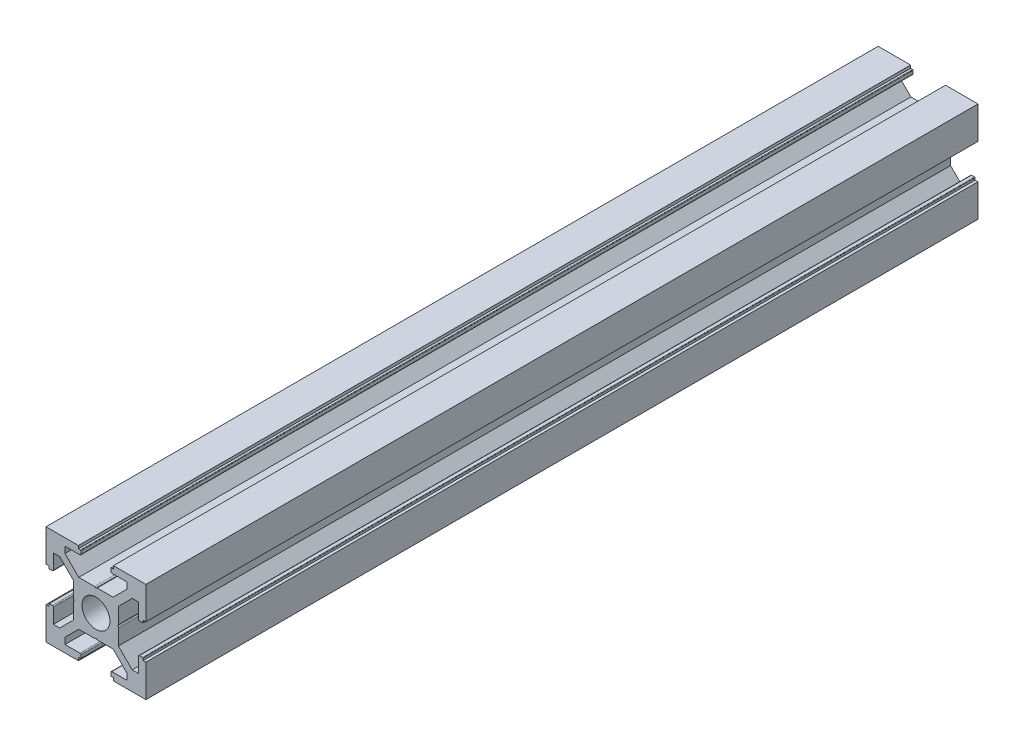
ISO-10303-21;
HEADER;
FILE_DESCRIPTION(('STEP AP214'),'2;1');
FILE_NAME('part.step','',(''),(''),'','','');
FILE_SCHEMA(('AUTOMOTIVE_DESIGN { 1 0 10303 214 1 1 1 1 }'));
ENDSEC;
DATA;
#1=APPLICATION_CONTEXT('core data for automotive mechanical design processes');
#2=APPLICATION_PROTOCOL_DEFINITION('international standard','automotive_design',2000,#1);
#3=PRODUCT_CONTEXT('',#1,'mechanical');
#4=PRODUCT('Part','Part','',(#3));
#5=PRODUCT_RELATED_PRODUCT_CATEGORY('part','',(#4));
#6=PRODUCT_DEFINITION_FORMATION('','',#4);
#7=PRODUCT_DEFINITION_CONTEXT('part definition',#1,'design');
#8=PRODUCT_DEFINITION('design','',#6,#7);
#9=PRODUCT_DEFINITION_SHAPE('','',#8);
#10=(LENGTH_UNIT() NAMED_UNIT(*) SI_UNIT(.MILLI.,.METRE.));
#11=(NAMED_UNIT(*) PLANE_ANGLE_UNIT() SI_UNIT($,.RADIAN.));
#12=(NAMED_UNIT(*) SI_UNIT($,.STERADIAN.) SOLID_ANGLE_UNIT());
#13=UNCERTAINTY_MEASURE_WITH_UNIT(LENGTH_MEASURE(1.E-05),#10,'distance_accuracy_value','');
#14=(GEOMETRIC_REPRESENTATION_CONTEXT(3) GLOBAL_UNCERTAINTY_ASSIGNED_CONTEXT((#13)) GLOBAL_UNIT_ASSIGNED_CONTEXT((#10,
#11,#12)) REPRESENTATION_CONTEXT('',''));
#15=CARTESIAN_POINT('',(0.,0.,0.));
#16=DIRECTION('',(0.,0.,1.));
#17=DIRECTION('',(1.,0.,0.));
#18=AXIS2_PLACEMENT_3D('',#15,#16,#17);
#19=CARTESIAN_POINT('',(0.45,-6.3,250.));
#20=DIRECTION('',(0.,0.,-1.));
#21=DIRECTION('',(-1.,0.,0.));
#22=AXIS2_PLACEMENT_3D('',#19,#20,#21);
#23=CYLINDRICAL_SURFACE('',#22,0.45);
#24=CARTESIAN_POINT('',(0.45,-6.3,0.));
#25=DIRECTION('',(0.,0.,1.));
#26=DIRECTION('',(1.,0.,0.));
#27=AXIS2_PLACEMENT_3D('',#24,#25,#26);
#28=CIRCLE('',#27,0.45);
#29=CARTESIAN_POINT('',(0.450000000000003,-6.75,0.));
#30=VERTEX_POINT('',#29);
#31=CARTESIAN_POINT('',(0.,-6.3,0.));
#32=VERTEX_POINT('',#31);
#33=EDGE_CURVE('E579',#30,#32,#28,.F.);
#34=ORIENTED_EDGE('',*,*,#33,.F.);
#35=DIRECTION('',(0.,0.,-1.));
#36=VECTOR('',#35,1.);
#37=CARTESIAN_POINT('',(0.450000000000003,-6.75,250.));
#38=LINE('',#37,#36);
#39=CARTESIAN_POINT('',(0.450000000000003,-6.75,250.));
#40=VERTEX_POINT('',#39);
#41=EDGE_CURVE('E11',#40,#30,#38,.T.);
#42=ORIENTED_EDGE('',*,*,#41,.F.);
#43=CARTESIAN_POINT('',(0.45,-6.3,250.));
#44=DIRECTION('',(0.,0.,1.));
#45=DIRECTION('',(1.,0.,0.));
#46=AXIS2_PLACEMENT_3D('',#43,#44,#45);
#47=CIRCLE('',#46,0.45);
#48=CARTESIAN_POINT('',(0.,-6.3,250.));
#49=VERTEX_POINT('',#48);
#50=EDGE_CURVE('E821',#40,#49,#47,.F.);
#51=ORIENTED_EDGE('',*,*,#50,.T.);
#52=DIRECTION('',(0.,0.,-1.));
#53=VECTOR('',#52,1.);
#54=CARTESIAN_POINT('',(0.,-6.3,250.));
#55=LINE('',#54,#53);
#56=EDGE_CURVE('E580',#49,#32,#55,.T.);
#57=ORIENTED_EDGE('',*,*,#56,.T.);
#58=EDGE_LOOP('',(#34,#42,#51,#57));
#59=FACE_BOUND('',#58,.T.);
#60=ADVANCED_FACE('F26',(#59),#23,.T.);
#61=CARTESIAN_POINT('',(0.,-6.75,250.));
#62=DIRECTION('',(0.,-1.,0.));
#63=DIRECTION('',(0.,0.,-1.));
#64=AXIS2_PLACEMENT_3D('',#61,#62,#63);
#65=PLANE('',#64);
#66=DIRECTION('',(-1.,0.,0.));
#67=VECTOR('',#66,1.);
#68=CARTESIAN_POINT('',(0.,-6.75,0.));
#69=LINE('',#68,#67);
#70=CARTESIAN_POINT('',(5.15900974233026,-6.75,0.));
#71=VERTEX_POINT('',#70);
#72=EDGE_CURVE('E572',#71,#30,#69,.T.);
#73=ORIENTED_EDGE('',*,*,#72,.F.);
#74=DIRECTION('',(0.,0.,-1.));
#75=VECTOR('',#74,1.);
#76=CARTESIAN_POINT('',(5.15900974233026,-6.75,250.));
#77=LINE('',#76,#75);
#78=CARTESIAN_POINT('',(5.15900974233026,-6.75,250.));
#79=VERTEX_POINT('',#78);
#80=EDGE_CURVE('E33',#79,#71,#77,.T.);
#81=ORIENTED_EDGE('',*,*,#80,.F.);
#82=DIRECTION('',(-1.,0.,0.));
#83=VECTOR('',#82,1.);
#84=CARTESIAN_POINT('',(0.,-6.75,250.));
#85=LINE('',#84,#83);
#86=EDGE_CURVE('E575',#79,#40,#85,.T.);
#87=ORIENTED_EDGE('',*,*,#86,.T.);
#88=ORIENTED_EDGE('',*,*,#41,.T.);
#89=EDGE_LOOP('',(#73,#81,#87,#88));
#90=FACE_BOUND('',#89,.T.);
#91=ADVANCED_FACE('F570',(#90),#65,.T.);
#92=CARTESIAN_POINT('',(15.7752155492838,-17.3662058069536,250.));
#93=DIRECTION('',(-0.707106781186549,-0.707106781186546,0.));
#94=DIRECTION('',(0.707106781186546,-0.707106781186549,0.));
#95=AXIS2_PLACEMENT_3D('',#92,#93,#94);
#96=PLANE('',#95);
#97=DIRECTION('',(-0.707106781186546,0.707106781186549,0.));
#98=VECTOR('',#97,1.);
#99=CARTESIAN_POINT('',(15.7752155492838,-17.3662058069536,0.));
#100=LINE('',#99,#98);
#101=CARTESIAN_POINT('',(9.3,-10.8909902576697,0.));
#102=VERTEX_POINT('',#101);
#103=EDGE_CURVE('E589',#102,#71,#100,.T.);
#104=ORIENTED_EDGE('',*,*,#103,.F.);
#105=DIRECTION('',(0.,0.,-1.));
#106=VECTOR('',#105,1.);
#107=CARTESIAN_POINT('',(9.3,-10.8909902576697,250.));
#108=LINE('',#107,#106);
#109=CARTESIAN_POINT('',(9.3,-10.8909902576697,250.));
#110=VERTEX_POINT('',#109);
#111=EDGE_CURVE('E1236',#110,#102,#108,.T.);
#112=ORIENTED_EDGE('',*,*,#111,.F.);
#113=DIRECTION('',(-0.707106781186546,0.707106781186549,0.));
#114=VECTOR('',#113,1.);
#115=CARTESIAN_POINT('',(15.7752155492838,-17.3662058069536,250.));
#116=LINE('',#115,#114);
#117=EDGE_CURVE('E824',#110,#79,#116,.T.);
#118=ORIENTED_EDGE('',*,*,#117,.T.);
#119=ORIENTED_EDGE('',*,*,#80,.T.);
#120=EDGE_LOOP('',(#104,#112,#118,#119));
#121=FACE_BOUND('',#120,.T.);
#122=ADVANCED_FACE('F1238',(#121),#96,.T.);
#123=CARTESIAN_POINT('',(9.3,-33.1414213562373,250.));
#124=DIRECTION('',(-1.,0.,0.));
#125=DIRECTION('',(0.,0.,1.));
#126=AXIS2_PLACEMENT_3D('',#123,#124,#125);
#127=PLANE('',#126);
#128=DIRECTION('',(0.,1.,0.));
#129=VECTOR('',#128,1.);
#130=CARTESIAN_POINT('',(9.3,-33.1414213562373,0.));
#131=LINE('',#130,#129);
#132=CARTESIAN_POINT('',(9.3,-12.795,0.));
#133=VERTEX_POINT('',#132);
#134=EDGE_CURVE('E591',#133,#102,#131,.T.);
#135=ORIENTED_EDGE('',*,*,#134,.F.);
#136=DIRECTION('',(0.,0.,-1.));
#137=VECTOR('',#136,1.);
#138=CARTESIAN_POINT('',(9.3,-12.795,250.));
#139=LINE('',#138,#137);
#140=CARTESIAN_POINT('',(9.3,-12.795,250.));
#141=VERTEX_POINT('',#140);
#142=EDGE_CURVE('E1234',#141,#133,#139,.T.);
#143=ORIENTED_EDGE('',*,*,#142,.F.);
#144=DIRECTION('',(0.,1.,0.));
#145=VECTOR('',#144,1.);
#146=CARTESIAN_POINT('',(9.3,-33.1414213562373,250.));
#147=LINE('',#146,#145);
#148=EDGE_CURVE('E827',#141,#110,#147,.T.);
#149=ORIENTED_EDGE('',*,*,#148,.T.);
#150=ORIENTED_EDGE('',*,*,#111,.T.);
#151=EDGE_LOOP('',(#135,#143,#149,#150));
#152=FACE_BOUND('',#151,.T.);
#153=ADVANCED_FACE('F1245',(#152),#127,.T.);
#154=CARTESIAN_POINT('',(0.,-12.795,250.));
#155=DIRECTION('',(0.,-1.,0.));
#156=DIRECTION('',(0.,0.,-1.));
#157=AXIS2_PLACEMENT_3D('',#154,#155,#156);
#158=PLANE('',#157);
#159=DIRECTION('',(-1.,0.,0.));
#160=VECTOR('',#159,1.);
#161=CARTESIAN_POINT('',(0.,-12.795,0.));
#162=LINE('',#161,#160);
#163=CARTESIAN_POINT('',(4.80000000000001,-12.795,0.));
#164=VERTEX_POINT('',#163);
#165=EDGE_CURVE('E595',#133,#164,#162,.T.);
#166=ORIENTED_EDGE('',*,*,#165,.T.);
#167=DIRECTION('',(0.,0.,-1.));
#168=VECTOR('',#167,1.);
#169=CARTESIAN_POINT('',(4.80000000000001,-12.795,250.));
#170=LINE('',#169,#168);
#171=CARTESIAN_POINT('',(4.80000000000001,-12.795,250.));
#172=VERTEX_POINT('',#171);
#173=EDGE_CURVE('E1231',#172,#164,#170,.T.);
#174=ORIENTED_EDGE('',*,*,#173,.F.);
#175=DIRECTION('',(-1.,0.,0.));
#176=VECTOR('',#175,1.);
#177=CARTESIAN_POINT('',(0.,-12.795,250.));
#178=LINE('',#177,#176);
#179=EDGE_CURVE('E830',#141,#172,#178,.T.);
#180=ORIENTED_EDGE('',*,*,#179,.F.);
#181=ORIENTED_EDGE('',*,*,#142,.T.);
#182=EDGE_LOOP('',(#166,#174,#180,#181));
#183=FACE_BOUND('',#182,.T.);
#184=ADVANCED_FACE('F1250',(#183),#158,.F.);
#185=CARTESIAN_POINT('',(4.8,-13.095,250.));
#186=DIRECTION('',(0.,0.,-1.));
#187=DIRECTION('',(-1.,0.,0.));
#188=AXIS2_PLACEMENT_3D('',#185,#186,#187);
#189=CYLINDRICAL_SURFACE('',#188,0.300000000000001);
#190=CARTESIAN_POINT('',(4.8,-13.095,0.));
#191=DIRECTION('',(0.,0.,1.));
#192=DIRECTION('',(1.,0.,0.));
#193=AXIS2_PLACEMENT_3D('',#190,#191,#192);
#194=CIRCLE('',#193,0.300000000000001);
#195=CARTESIAN_POINT('',(4.5,-13.095,0.));
#196=VERTEX_POINT('',#195);
#197=EDGE_CURVE('E597',#164,#196,#194,.T.);
#198=ORIENTED_EDGE('',*,*,#197,.T.);
#199=DIRECTION('',(0.,0.,-1.));
#200=VECTOR('',#199,1.);
#201=CARTESIAN_POINT('',(4.5,-13.095,250.));
#202=LINE('',#201,#200);
#203=CARTESIAN_POINT('',(4.5,-13.095,250.));
#204=VERTEX_POINT('',#203);
#205=EDGE_CURVE('E1228',#204,#196,#202,.T.);
#206=ORIENTED_EDGE('',*,*,#205,.F.);
#207=CARTESIAN_POINT('',(4.8,-13.095,250.));
#208=DIRECTION('',(0.,0.,1.));
#209=DIRECTION('',(1.,0.,0.));
#210=AXIS2_PLACEMENT_3D('',#207,#208,#209);
#211=CIRCLE('',#210,0.300000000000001);
#212=EDGE_CURVE('E832',#172,#204,#211,.T.);
#213=ORIENTED_EDGE('',*,*,#212,.F.);
#214=ORIENTED_EDGE('',*,*,#173,.T.);
#215=EDGE_LOOP('',(#198,#206,#213,#214));
#216=FACE_BOUND('',#215,.T.);
#217=ADVANCED_FACE('F1256',(#216),#189,.T.);
#218=CARTESIAN_POINT('',(4.5,-33.1414213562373,250.));
#219=DIRECTION('',(1.,0.,0.));
#220=DIRECTION('',(0.,0.,-1.));
#221=AXIS2_PLACEMENT_3D('',#218,#219,#220);
#222=PLANE('',#221);
#223=DIRECTION('',(0.,-1.,0.));
#224=VECTOR('',#223,1.);
#225=CARTESIAN_POINT('',(4.5,-33.1414213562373,0.));
#226=LINE('',#225,#224);
#227=CARTESIAN_POINT('',(4.5,-13.995,0.));
#228=VERTEX_POINT('',#227);
#229=EDGE_CURVE('E599',#196,#228,#226,.T.);
#230=ORIENTED_EDGE('',*,*,#229,.T.);
#231=DIRECTION('',(0.,0.,-1.));
#232=VECTOR('',#231,1.);
#233=CARTESIAN_POINT('',(4.5,-13.995,250.));
#234=LINE('',#233,#232);
#235=CARTESIAN_POINT('',(4.5,-13.995,250.));
#236=VERTEX_POINT('',#235);
#237=EDGE_CURVE('E1225',#236,#228,#234,.T.);
#238=ORIENTED_EDGE('',*,*,#237,.F.);
#239=DIRECTION('',(0.,-1.,0.));
#240=VECTOR('',#239,1.);
#241=CARTESIAN_POINT('',(4.5,-33.1414213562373,250.));
#242=LINE('',#241,#240);
#243=EDGE_CURVE('E834',#204,#236,#242,.T.);
#244=ORIENTED_EDGE('',*,*,#243,.F.);
#245=ORIENTED_EDGE('',*,*,#205,.T.);
#246=EDGE_LOOP('',(#230,#238,#244,#245));
#247=FACE_BOUND('',#246,.T.);
#248=ADVANCED_FACE('F1260',(#247),#222,.F.);
#249=CARTESIAN_POINT('',(4.65,-13.995,250.));
#250=DIRECTION('',(0.,0.,-1.));
#251=DIRECTION('',(-1.,0.,0.));
#252=AXIS2_PLACEMENT_3D('',#249,#250,#251);
#253=CYLINDRICAL_SURFACE('',#252,0.15);
#254=CARTESIAN_POINT('',(4.65,-13.995,0.));
#255=DIRECTION('',(0.,0.,1.));
#256=DIRECTION('',(1.,0.,0.));
#257=AXIS2_PLACEMENT_3D('',#254,#255,#256);
#258=CIRCLE('',#257,0.15);
#259=CARTESIAN_POINT('',(4.65,-14.145,0.));
#260=VERTEX_POINT('',#259);
#261=EDGE_CURVE('E601',#228,#260,#258,.T.);
#262=ORIENTED_EDGE('',*,*,#261,.T.);
#263=DIRECTION('',(0.,0.,-1.));
#264=VECTOR('',#263,1.);
#265=CARTESIAN_POINT('',(4.65,-14.145,250.));
#266=LINE('',#265,#264);
#267=CARTESIAN_POINT('',(4.65,-14.145,250.));
#268=VERTEX_POINT('',#267);
#269=EDGE_CURVE('E1222',#268,#260,#266,.T.);
#270=ORIENTED_EDGE('',*,*,#269,.F.);
#271=CARTESIAN_POINT('',(4.65,-13.995,250.));
#272=DIRECTION('',(0.,0.,1.));
#273=DIRECTION('',(1.,0.,0.));
#274=AXIS2_PLACEMENT_3D('',#271,#272,#273);
#275=CIRCLE('',#274,0.15);
#276=EDGE_CURVE('E836',#236,#268,#275,.T.);
#277=ORIENTED_EDGE('',*,*,#276,.F.);
#278=ORIENTED_EDGE('',*,*,#237,.T.);
#279=EDGE_LOOP('',(#262,#270,#277,#278));
#280=FACE_BOUND('',#279,.T.);
#281=ADVANCED_FACE('F1265',(#280),#253,.T.);
#282=CARTESIAN_POINT('',(0.,-14.145,250.));
#283=DIRECTION('',(0.,1.,0.));
#284=DIRECTION('',(0.,0.,1.));
#285=AXIS2_PLACEMENT_3D('',#282,#283,#284);
#286=PLANE('',#285);
#287=DIRECTION('',(1.,0.,0.));
#288=VECTOR('',#287,1.);
#289=CARTESIAN_POINT('',(0.,-14.145,0.));
#290=LINE('',#289,#288);
#291=CARTESIAN_POINT('',(5.25,-14.145,0.));
#292=VERTEX_POINT('',#291);
#293=EDGE_CURVE('E603',#260,#292,#290,.T.);
#294=ORIENTED_EDGE('',*,*,#293,.T.);
#295=DIRECTION('',(0.,0.,-1.));
#296=VECTOR('',#295,1.);
#297=CARTESIAN_POINT('',(5.25,-14.145,250.));
#298=LINE('',#297,#296);
#299=CARTESIAN_POINT('',(5.25,-14.145,250.));
#300=VERTEX_POINT('',#299);
#301=EDGE_CURVE('E1219',#300,#292,#298,.T.);
#302=ORIENTED_EDGE('',*,*,#301,.F.);
#303=DIRECTION('',(1.,0.,0.));
#304=VECTOR('',#303,1.);
#305=CARTESIAN_POINT('',(0.,-14.145,250.));
#306=LINE('',#305,#304);
#307=EDGE_CURVE('E838',#268,#300,#306,.T.);
#308=ORIENTED_EDGE('',*,*,#307,.F.);
#309=ORIENTED_EDGE('',*,*,#269,.T.);
#310=EDGE_LOOP('',(#294,#302,#308,#309));
#311=FACE_BOUND('',#310,.T.);
#312=ADVANCED_FACE('F1272',(#311),#286,.F.);
#313=CARTESIAN_POINT('',(5.25,-33.1414213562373,250.));
#314=DIRECTION('',(1.,0.,0.));
#315=DIRECTION('',(0.,0.,-1.));
#316=AXIS2_PLACEMENT_3D('',#313,#314,#315);
#317=PLANE('',#316);
#318=DIRECTION('',(0.,-1.,0.));
#319=VECTOR('',#318,1.);
#320=CARTESIAN_POINT('',(5.25,-33.1414213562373,0.));
#321=LINE('',#320,#319);
#322=CARTESIAN_POINT('',(5.25,-15.,0.));
#323=VERTEX_POINT('',#322);
#324=EDGE_CURVE('E605',#292,#323,#321,.T.);
#325=ORIENTED_EDGE('',*,*,#324,.T.);
#326=DIRECTION('',(0.,0.,-1.));
#327=VECTOR('',#326,1.);
#328=CARTESIAN_POINT('',(5.25,-15.,250.));
#329=LINE('',#328,#327);
#330=CARTESIAN_POINT('',(5.25,-15.,250.));
#331=VERTEX_POINT('',#330);
#332=EDGE_CURVE('E1217',#331,#323,#329,.T.);
#333=ORIENTED_EDGE('',*,*,#332,.F.);
#334=DIRECTION('',(0.,-1.,0.));
#335=VECTOR('',#334,1.);
#336=CARTESIAN_POINT('',(5.25,-33.1414213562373,250.));
#337=LINE('',#336,#335);
#338=EDGE_CURVE('E840',#300,#331,#337,.T.);
#339=ORIENTED_EDGE('',*,*,#338,.F.);
#340=ORIENTED_EDGE('',*,*,#301,.T.);
#341=EDGE_LOOP('',(#325,#333,#339,#340));
#342=FACE_BOUND('',#341,.T.);
#343=ADVANCED_FACE('F1276',(#342),#317,.F.);
#344=CARTESIAN_POINT('',(0.,-15.,250.));
#345=DIRECTION('',(0.,-1.,0.));
#346=DIRECTION('',(0.,0.,-1.));
#347=AXIS2_PLACEMENT_3D('',#344,#345,#346);
#348=PLANE('',#347);
#349=DIRECTION('',(-1.,0.,0.));
#350=VECTOR('',#349,1.);
#351=CARTESIAN_POINT('',(0.,-15.,0.));
#352=LINE('',#351,#350);
#353=CARTESIAN_POINT('',(15.,-15.,0.));
#354=VERTEX_POINT('',#353);
#355=EDGE_CURVE('E608',#354,#323,#352,.T.);
#356=ORIENTED_EDGE('',*,*,#355,.F.);
#357=DIRECTION('',(0.,0.,-1.));
#358=VECTOR('',#357,1.);
#359=CARTESIAN_POINT('',(15.,-15.,250.));
#360=LINE('',#359,#358);
#361=CARTESIAN_POINT('',(15.,-15.,250.));
#362=VERTEX_POINT('',#361);
#363=EDGE_CURVE('E1215',#362,#354,#360,.T.);
#364=ORIENTED_EDGE('',*,*,#363,.F.);
#365=DIRECTION('',(-1.,0.,0.));
#366=VECTOR('',#365,1.);
#367=CARTESIAN_POINT('',(0.,-15.,250.));
#368=LINE('',#367,#366);
#369=EDGE_CURVE('E842',#362,#331,#368,.T.);
#370=ORIENTED_EDGE('',*,*,#369,.T.);
#371=ORIENTED_EDGE('',*,*,#332,.T.);
#372=EDGE_LOOP('',(#356,#364,#370,#371));
#373=FACE_BOUND('',#372,.T.);
#374=ADVANCED_FACE('F1279',(#373),#348,.T.);
#375=CARTESIAN_POINT('',(15.,-33.1414213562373,250.));
#376=DIRECTION('',(-1.,0.,0.));
#377=DIRECTION('',(0.,-1.,0.));
#378=AXIS2_PLACEMENT_3D('',#375,#376,#377);
#379=PLANE('',#378);
#380=DIRECTION('',(0.,1.,0.));
#381=VECTOR('',#380,1.);
#382=CARTESIAN_POINT('',(15.,-33.1414213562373,0.));
#383=LINE('',#382,#381);
#384=CARTESIAN_POINT('',(15.,-5.25000000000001,0.));
#385=VERTEX_POINT('',#384);
#386=EDGE_CURVE('E611',#354,#385,#383,.T.);
#387=ORIENTED_EDGE('',*,*,#386,.T.);
#388=DIRECTION('',(0.,0.,-1.));
#389=VECTOR('',#388,1.);
#390=CARTESIAN_POINT('',(15.,-5.25000000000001,250.));
#391=LINE('',#390,#389);
#392=CARTESIAN_POINT('',(15.,-5.25000000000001,250.));
#393=VERTEX_POINT('',#392);
#394=EDGE_CURVE('E1213',#393,#385,#391,.T.);
#395=ORIENTED_EDGE('',*,*,#394,.F.);
#396=DIRECTION('',(0.,1.,0.));
#397=VECTOR('',#396,1.);
#398=CARTESIAN_POINT('',(15.,-33.1414213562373,250.));
#399=LINE('',#398,#397);
#400=EDGE_CURVE('E845',#362,#393,#399,.T.);
#401=ORIENTED_EDGE('',*,*,#400,.F.);
#402=ORIENTED_EDGE('',*,*,#363,.T.);
#403=EDGE_LOOP('',(#387,#395,#401,#402));
#404=FACE_BOUND('',#403,.T.);
#405=ADVANCED_FACE('F1285',(#404),#379,.F.);
#406=CARTESIAN_POINT('',(0.,-5.24999999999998,250.));
#407=DIRECTION('',(0.,1.,0.));
#408=DIRECTION('',(-1.,0.,0.));
#409=AXIS2_PLACEMENT_3D('',#406,#407,#408);
#410=PLANE('',#409);
#411=DIRECTION('',(1.,0.,0.));
#412=VECTOR('',#411,1.);
#413=CARTESIAN_POINT('',(0.,-5.24999999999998,0.));
#414=LINE('',#413,#412);
#415=CARTESIAN_POINT('',(14.145,-5.25,0.));
#416=VERTEX_POINT('',#415);
#417=EDGE_CURVE('E614',#416,#385,#414,.T.);
#418=ORIENTED_EDGE('',*,*,#417,.F.);
#419=DIRECTION('',(0.,0.,-1.));
#420=VECTOR('',#419,1.);
#421=CARTESIAN_POINT('',(14.145,-5.25,250.));
#422=LINE('',#421,#420);
#423=CARTESIAN_POINT('',(14.145,-5.25,250.));
#424=VERTEX_POINT('',#423);
#425=EDGE_CURVE('E1211',#424,#416,#422,.T.);
#426=ORIENTED_EDGE('',*,*,#425,.F.);
#427=DIRECTION('',(1.,0.,0.));
#428=VECTOR('',#427,1.);
#429=CARTESIAN_POINT('',(0.,-5.24999999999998,250.));
#430=LINE('',#429,#428);
#431=EDGE_CURVE('E847',#424,#393,#430,.T.);
#432=ORIENTED_EDGE('',*,*,#431,.T.);
#433=ORIENTED_EDGE('',*,*,#394,.T.);
#434=EDGE_LOOP('',(#418,#426,#432,#433));
#435=FACE_BOUND('',#434,.T.);
#436=ADVANCED_FACE('F1289',(#435),#410,.T.);
#437=CARTESIAN_POINT('',(14.145,-33.1414213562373,250.));
#438=DIRECTION('',(1.,0.,0.));
#439=DIRECTION('',(0.,0.,-1.));
#440=AXIS2_PLACEMENT_3D('',#437,#438,#439);
#441=PLANE('',#440);
#442=DIRECTION('',(0.,-1.,0.));
#443=VECTOR('',#442,1.);
#444=CARTESIAN_POINT('',(14.145,-33.1414213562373,0.));
#445=LINE('',#444,#443);
#446=CARTESIAN_POINT('',(14.145,-4.65,0.));
#447=VERTEX_POINT('',#446);
#448=EDGE_CURVE('E617',#447,#416,#445,.T.);
#449=ORIENTED_EDGE('',*,*,#448,.F.);
#450=DIRECTION('',(0.,0.,-1.));
#451=VECTOR('',#450,1.);
#452=CARTESIAN_POINT('',(14.145,-4.65,250.));
#453=LINE('',#452,#451);
#454=CARTESIAN_POINT('',(14.145,-4.65,250.));
#455=VERTEX_POINT('',#454);
#456=EDGE_CURVE('E1209',#455,#447,#453,.T.);
#457=ORIENTED_EDGE('',*,*,#456,.F.);
#458=DIRECTION('',(0.,-1.,0.));
#459=VECTOR('',#458,1.);
#460=CARTESIAN_POINT('',(14.145,-33.1414213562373,250.));
#461=LINE('',#460,#459);
#462=EDGE_CURVE('E850',#455,#424,#461,.T.);
#463=ORIENTED_EDGE('',*,*,#462,.T.);
#464=ORIENTED_EDGE('',*,*,#425,.T.);
#465=EDGE_LOOP('',(#449,#457,#463,#464));
#466=FACE_BOUND('',#465,.T.);
#467=ADVANCED_FACE('F1292',(#466),#441,.T.);
#468=CARTESIAN_POINT('',(13.995,-4.65,250.));
#469=DIRECTION('',(0.,0.,-1.));
#470=DIRECTION('',(-1.,0.,0.));
#471=AXIS2_PLACEMENT_3D('',#468,#469,#470);
#472=CYLINDRICAL_SURFACE('',#471,0.15);
#473=CARTESIAN_POINT('',(13.995,-4.65,0.));
#474=DIRECTION('',(0.,0.,1.));
#475=DIRECTION('',(1.,0.,0.));
#476=AXIS2_PLACEMENT_3D('',#473,#474,#475);
#477=CIRCLE('',#476,0.15);
#478=CARTESIAN_POINT('',(13.995,-4.5,0.));
#479=VERTEX_POINT('',#478);
#480=EDGE_CURVE('E620',#479,#447,#477,.F.);
#481=ORIENTED_EDGE('',*,*,#480,.F.);
#482=DIRECTION('',(0.,0.,-1.));
#483=VECTOR('',#482,1.);
#484=CARTESIAN_POINT('',(13.995,-4.5,250.));
#485=LINE('',#484,#483);
#486=CARTESIAN_POINT('',(13.995,-4.5,250.));
#487=VERTEX_POINT('',#486);
#488=EDGE_CURVE('E1207',#487,#479,#485,.T.);
#489=ORIENTED_EDGE('',*,*,#488,.F.);
#490=CARTESIAN_POINT('',(13.995,-4.65,250.));
#491=DIRECTION('',(0.,0.,1.));
#492=DIRECTION('',(1.,0.,0.));
#493=AXIS2_PLACEMENT_3D('',#490,#491,#492);
#494=CIRCLE('',#493,0.15);
#495=EDGE_CURVE('E853',#487,#455,#494,.F.);
#496=ORIENTED_EDGE('',*,*,#495,.T.);
#497=ORIENTED_EDGE('',*,*,#456,.T.);
#498=EDGE_LOOP('',(#481,#489,#496,#497));
#499=FACE_BOUND('',#498,.T.);
#500=ADVANCED_FACE('F1297',(#499),#472,.T.);
#501=CARTESIAN_POINT('',(0.,-4.5,250.));
#502=DIRECTION('',(0.,1.,0.));
#503=DIRECTION('',(0.,0.,1.));
#504=AXIS2_PLACEMENT_3D('',#501,#502,#503);
#505=PLANE('',#504);
#506=DIRECTION('',(1.,0.,0.));
#507=VECTOR('',#506,1.);
#508=CARTESIAN_POINT('',(0.,-4.5,0.));
#509=LINE('',#508,#507);
#510=CARTESIAN_POINT('',(13.095,-4.5,0.));
#511=VERTEX_POINT('',#510);
#512=EDGE_CURVE('E623',#511,#479,#509,.T.);
#513=ORIENTED_EDGE('',*,*,#512,.F.);
#514=DIRECTION('',(0.,0.,-1.));
#515=VECTOR('',#514,1.);
#516=CARTESIAN_POINT('',(13.095,-4.5,250.));
#517=LINE('',#516,#515);
#518=CARTESIAN_POINT('',(13.095,-4.5,250.));
#519=VERTEX_POINT('',#518);
#520=EDGE_CURVE('E1205',#519,#511,#517,.T.);
#521=ORIENTED_EDGE('',*,*,#520,.F.);
#522=DIRECTION('',(1.,0.,0.));
#523=VECTOR('',#522,1.);
#524=CARTESIAN_POINT('',(0.,-4.5,250.));
#525=LINE('',#524,#523);
#526=EDGE_CURVE('E856',#519,#487,#525,.T.);
#527=ORIENTED_EDGE('',*,*,#526,.T.);
#528=ORIENTED_EDGE('',*,*,#488,.T.);
#529=EDGE_LOOP('',(#513,#521,#527,#528));
#530=FACE_BOUND('',#529,.T.);
#531=ADVANCED_FACE('F1300',(#530),#505,.T.);
#532=CARTESIAN_POINT('',(13.095,-4.80000000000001,250.));
#533=DIRECTION('',(0.,0.,-1.));
#534=DIRECTION('',(-1.,0.,0.));
#535=AXIS2_PLACEMENT_3D('',#532,#533,#534);
#536=CYLINDRICAL_SURFACE('',#535,0.300000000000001);
#537=CARTESIAN_POINT('',(13.095,-4.80000000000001,0.));
#538=DIRECTION('',(0.,0.,1.));
#539=DIRECTION('',(1.,0.,0.));
#540=AXIS2_PLACEMENT_3D('',#537,#538,#539);
#541=CIRCLE('',#540,0.300000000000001);
#542=CARTESIAN_POINT('',(12.795,-4.80000000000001,0.));
#543=VERTEX_POINT('',#542);
#544=EDGE_CURVE('E626',#543,#511,#541,.F.);
#545=ORIENTED_EDGE('',*,*,#544,.F.);
#546=DIRECTION('',(0.,0.,-1.));
#547=VECTOR('',#546,1.);
#548=CARTESIAN_POINT('',(12.795,-4.80000000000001,250.));
#549=LINE('',#548,#547);
#550=CARTESIAN_POINT('',(12.795,-4.80000000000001,250.));
#551=VERTEX_POINT('',#550);
#552=EDGE_CURVE('E1203',#551,#543,#549,.T.);
#553=ORIENTED_EDGE('',*,*,#552,.F.);
#554=CARTESIAN_POINT('',(13.095,-4.80000000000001,250.));
#555=DIRECTION('',(0.,0.,1.));
#556=DIRECTION('',(1.,0.,0.));
#557=AXIS2_PLACEMENT_3D('',#554,#555,#556);
#558=CIRCLE('',#557,0.300000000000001);
#559=EDGE_CURVE('E859',#551,#519,#558,.F.);
#560=ORIENTED_EDGE('',*,*,#559,.T.);
#561=ORIENTED_EDGE('',*,*,#520,.T.);
#562=EDGE_LOOP('',(#545,#553,#560,#561));
#563=FACE_BOUND('',#562,.T.);
#564=ADVANCED_FACE('F1305',(#563),#536,.T.);
#565=CARTESIAN_POINT('',(12.795,-33.1414213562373,250.));
#566=DIRECTION('',(-1.,0.,0.));
#567=DIRECTION('',(0.,-1.,0.));
#568=AXIS2_PLACEMENT_3D('',#565,#566,#567);
#569=PLANE('',#568);
#570=DIRECTION('',(0.,1.,0.));
#571=VECTOR('',#570,1.);
#572=CARTESIAN_POINT('',(12.795,-33.1414213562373,0.));
#573=LINE('',#572,#571);
#574=CARTESIAN_POINT('',(12.795,-9.3,0.));
#575=VERTEX_POINT('',#574);
#576=EDGE_CURVE('E629',#575,#543,#573,.T.);
#577=ORIENTED_EDGE('',*,*,#576,.F.);
#578=DIRECTION('',(0.,0.,-1.));
#579=VECTOR('',#578,1.);
#580=CARTESIAN_POINT('',(12.795,-9.3,250.));
#581=LINE('',#580,#579);
#582=CARTESIAN_POINT('',(12.795,-9.3,250.));
#583=VERTEX_POINT('',#582);
#584=EDGE_CURVE('E1201',#583,#575,#581,.T.);
#585=ORIENTED_EDGE('',*,*,#584,.F.);
#586=DIRECTION('',(0.,1.,0.));
#587=VECTOR('',#586,1.);
#588=CARTESIAN_POINT('',(12.795,-33.1414213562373,250.));
#589=LINE('',#588,#587);
#590=EDGE_CURVE('E862',#583,#551,#589,.T.);
#591=ORIENTED_EDGE('',*,*,#590,.T.);
#592=ORIENTED_EDGE('',*,*,#552,.T.);
#593=EDGE_LOOP('',(#577,#585,#591,#592));
#594=FACE_BOUND('',#593,.T.);
#595=ADVANCED_FACE('F1308',(#594),#569,.T.);
#596=CARTESIAN_POINT('',(0.,-9.3,250.));
#597=DIRECTION('',(0.,-1.,0.));
#598=DIRECTION('',(0.,0.,-1.));
#599=AXIS2_PLACEMENT_3D('',#596,#597,#598);
#600=PLANE('',#599);
#601=DIRECTION('',(-1.,0.,0.));
#602=VECTOR('',#601,1.);
#603=CARTESIAN_POINT('',(0.,-9.3,0.));
#604=LINE('',#603,#602);
#605=CARTESIAN_POINT('',(10.8909902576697,-9.30000000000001,0.));
#606=VERTEX_POINT('',#605);
#607=EDGE_CURVE('E632',#575,#606,#604,.T.);
#608=ORIENTED_EDGE('',*,*,#607,.T.);
#609=DIRECTION('',(0.,0.,-1.));
#610=VECTOR('',#609,1.);
#611=CARTESIAN_POINT('',(10.8909902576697,-9.30000000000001,250.));
#612=LINE('',#611,#610);
#613=CARTESIAN_POINT('',(10.8909902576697,-9.30000000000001,250.));
#614=VERTEX_POINT('',#613);
#615=EDGE_CURVE('E1198',#614,#606,#612,.T.);
#616=ORIENTED_EDGE('',*,*,#615,.F.);
#617=DIRECTION('',(-1.,0.,0.));
#618=VECTOR('',#617,1.);
#619=CARTESIAN_POINT('',(0.,-9.3,250.));
#620=LINE('',#619,#618);
#621=EDGE_CURVE('E865',#583,#614,#620,.T.);
#622=ORIENTED_EDGE('',*,*,#621,.F.);
#623=ORIENTED_EDGE('',*,*,#584,.T.);
#624=EDGE_LOOP('',(#608,#616,#622,#623));
#625=FACE_BOUND('',#624,.T.);
#626=ADVANCED_FACE('F1315',(#625),#600,.F.);
#627=CARTESIAN_POINT('',(17.3662058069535,-15.7752155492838,250.));
#628=DIRECTION('',(-0.707106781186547,-0.707106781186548,0.));
#629=DIRECTION('',(0.707106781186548,-0.707106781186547,0.));
#630=AXIS2_PLACEMENT_3D('',#627,#628,#629);
#631=PLANE('',#630);
#632=DIRECTION('',(-0.707106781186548,0.707106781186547,0.));
#633=VECTOR('',#632,1.);
#634=CARTESIAN_POINT('',(17.3662058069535,-15.7752155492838,0.));
#635=LINE('',#634,#633);
#636=CARTESIAN_POINT('',(6.75,-5.15900974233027,0.));
#637=VERTEX_POINT('',#636);
#638=EDGE_CURVE('E634',#606,#637,#635,.T.);
#639=ORIENTED_EDGE('',*,*,#638,.T.);
#640=DIRECTION('',(0.,0.,-1.));
#641=VECTOR('',#640,1.);
#642=CARTESIAN_POINT('',(6.75,-5.15900974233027,250.));
#643=LINE('',#642,#641);
#644=CARTESIAN_POINT('',(6.75,-5.15900974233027,250.));
#645=VERTEX_POINT('',#644);
#646=EDGE_CURVE('E1196',#645,#637,#643,.T.);
#647=ORIENTED_EDGE('',*,*,#646,.F.);
#648=DIRECTION('',(-0.707106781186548,0.707106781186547,0.));
#649=VECTOR('',#648,1.);
#650=CARTESIAN_POINT('',(17.3662058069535,-15.7752155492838,250.));
#651=LINE('',#650,#649);
#652=EDGE_CURVE('E867',#614,#645,#651,.T.);
#653=ORIENTED_EDGE('',*,*,#652,.F.);
#654=ORIENTED_EDGE('',*,*,#615,.T.);
#655=EDGE_LOOP('',(#639,#647,#653,#654));
#656=FACE_BOUND('',#655,.T.);
#657=ADVANCED_FACE('F1319',(#656),#631,.F.);
#658=CARTESIAN_POINT('',(6.75,-33.1414213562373,250.));
#659=DIRECTION('',(1.,0.,0.));
#660=DIRECTION('',(0.,0.,-1.));
#661=AXIS2_PLACEMENT_3D('',#658,#659,#660);
#662=PLANE('',#661);
#663=DIRECTION('',(0.,-1.,0.));
#664=VECTOR('',#663,1.);
#665=CARTESIAN_POINT('',(6.75,-33.1414213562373,0.));
#666=LINE('',#665,#664);
#667=CARTESIAN_POINT('',(6.75,-0.450000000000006,0.));
#668=VERTEX_POINT('',#667);
#669=EDGE_CURVE('E637',#668,#637,#666,.T.);
#670=ORIENTED_EDGE('',*,*,#669,.F.);
#671=DIRECTION('',(0.,0.,-1.));
#672=VECTOR('',#671,1.);
#673=CARTESIAN_POINT('',(6.75,-0.450000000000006,250.));
#674=LINE('',#673,#672);
#675=CARTESIAN_POINT('',(6.75,-0.450000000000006,250.));
#676=VERTEX_POINT('',#675);
#677=EDGE_CURVE('E1194',#676,#668,#674,.T.);
#678=ORIENTED_EDGE('',*,*,#677,.F.);
#679=DIRECTION('',(0.,-1.,0.));
#680=VECTOR('',#679,1.);
#681=CARTESIAN_POINT('',(6.75,-33.1414213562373,250.));
#682=LINE('',#681,#680);
#683=EDGE_CURVE('E869',#676,#645,#682,.T.);
#684=ORIENTED_EDGE('',*,*,#683,.T.);
#685=ORIENTED_EDGE('',*,*,#646,.T.);
#686=EDGE_LOOP('',(#670,#678,#684,#685));
#687=FACE_BOUND('',#686,.T.);
#688=ADVANCED_FACE('F1322',(#687),#662,.T.);
#689=CARTESIAN_POINT('',(6.3,-0.45,250.));
#690=DIRECTION('',(0.,0.,-1.));
#691=DIRECTION('',(-1.,0.,0.));
#692=AXIS2_PLACEMENT_3D('',#689,#690,#691);
#693=CYLINDRICAL_SURFACE('',#692,0.45);
#694=CARTESIAN_POINT('',(6.3,-0.45,0.));
#695=DIRECTION('',(0.,0.,1.));
#696=DIRECTION('',(1.,0.,0.));
#697=AXIS2_PLACEMENT_3D('',#694,#695,#696);
#698=CIRCLE('',#697,0.45);
#699=CARTESIAN_POINT('',(6.3,0.,0.));
#700=VERTEX_POINT('',#699);
#701=EDGE_CURVE('E640',#668,#700,#698,.T.);
#702=ORIENTED_EDGE('',*,*,#701,.T.);
#703=DIRECTION('',(0.,0.,-1.));
#704=VECTOR('',#703,1.);
#705=CARTESIAN_POINT('',(6.3,0.,250.));
#706=LINE('',#705,#704);
#707=CARTESIAN_POINT('',(6.3,0.,250.));
#708=VERTEX_POINT('',#707);
#709=EDGE_CURVE('E1192',#708,#700,#706,.T.);
#710=ORIENTED_EDGE('',*,*,#709,.F.);
#711=CARTESIAN_POINT('',(6.3,-0.45,250.));
#712=DIRECTION('',(0.,0.,1.));
#713=DIRECTION('',(1.,0.,0.));
#714=AXIS2_PLACEMENT_3D('',#711,#712,#713);
#715=CIRCLE('',#714,0.45);
#716=EDGE_CURVE('E872',#676,#708,#715,.T.);
#717=ORIENTED_EDGE('',*,*,#716,.F.);
#718=ORIENTED_EDGE('',*,*,#677,.T.);
#719=EDGE_LOOP('',(#702,#710,#717,#718));
#720=FACE_BOUND('',#719,.T.);
#721=ADVANCED_FACE('F1327',(#720),#693,.T.);
#722=CARTESIAN_POINT('',(6.3,0.45,250.));
#723=DIRECTION('',(0.,0.,-1.));
#724=DIRECTION('',(-1.,0.,0.));
#725=AXIS2_PLACEMENT_3D('',#722,#723,#724);
#726=CYLINDRICAL_SURFACE('',#725,0.45);
#727=CARTESIAN_POINT('',(6.3,0.45,0.));
#728=DIRECTION('',(0.,0.,1.));
#729=DIRECTION('',(1.,0.,0.));
#730=AXIS2_PLACEMENT_3D('',#727,#728,#729);
#731=CIRCLE('',#730,0.45);
#732=CARTESIAN_POINT('',(6.75,0.450000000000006,0.));
#733=VERTEX_POINT('',#732);
#734=EDGE_CURVE('E643',#733,#700,#731,.F.);
#735=ORIENTED_EDGE('',*,*,#734,.F.);
#736=DIRECTION('',(0.,0.,-1.));
#737=VECTOR('',#736,1.);
#738=CARTESIAN_POINT('',(6.75,0.450000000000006,250.));
#739=LINE('',#738,#737);
#740=CARTESIAN_POINT('',(6.75,0.450000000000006,250.));
#741=VERTEX_POINT('',#740);
#742=EDGE_CURVE('E1190',#741,#733,#739,.T.);
#743=ORIENTED_EDGE('',*,*,#742,.F.);
#744=CARTESIAN_POINT('',(6.3,0.45,250.));
#745=DIRECTION('',(0.,0.,1.));
#746=DIRECTION('',(1.,0.,0.));
#747=AXIS2_PLACEMENT_3D('',#744,#745,#746);
#748=CIRCLE('',#747,0.45);
#749=EDGE_CURVE('E874',#741,#708,#748,.F.);
#750=ORIENTED_EDGE('',*,*,#749,.T.);
#751=ORIENTED_EDGE('',*,*,#709,.T.);
#752=EDGE_LOOP('',(#735,#743,#750,#751));
#753=FACE_BOUND('',#752,.T.);
#754=ADVANCED_FACE('F1331',(#753),#726,.T.);
#755=CARTESIAN_POINT('',(6.75,-33.1414213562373,250.));
#756=DIRECTION('',(-1.,0.,0.));
#757=DIRECTION('',(0.,0.,1.));
#758=AXIS2_PLACEMENT_3D('',#755,#756,#757);
#759=PLANE('',#758);
#760=DIRECTION('',(0.,1.,0.));
#761=VECTOR('',#760,1.);
#762=CARTESIAN_POINT('',(6.75,-33.1414213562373,0.));
#763=LINE('',#762,#761);
#764=CARTESIAN_POINT('',(6.75,5.15900974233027,0.));
#765=VERTEX_POINT('',#764);
#766=EDGE_CURVE('E646',#733,#765,#763,.T.);
#767=ORIENTED_EDGE('',*,*,#766,.T.);
#768=DIRECTION('',(0.,0.,-1.));
#769=VECTOR('',#768,1.);
#770=CARTESIAN_POINT('',(6.75,5.15900974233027,250.));
#771=LINE('',#770,#769);
#772=CARTESIAN_POINT('',(6.75,5.15900974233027,250.));
#773=VERTEX_POINT('',#772);
#774=EDGE_CURVE('E1188',#773,#765,#771,.T.);
#775=ORIENTED_EDGE('',*,*,#774,.F.);
#776=DIRECTION('',(0.,1.,0.));
#777=VECTOR('',#776,1.);
#778=CARTESIAN_POINT('',(6.75,-33.1414213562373,250.));
#779=LINE('',#778,#777);
#780=EDGE_CURVE('E877',#741,#773,#779,.T.);
#781=ORIENTED_EDGE('',*,*,#780,.F.);
#782=ORIENTED_EDGE('',*,*,#742,.T.);
#783=EDGE_LOOP('',(#767,#775,#781,#782));
#784=FACE_BOUND('',#783,.T.);
#785=ADVANCED_FACE('F1336',(#784),#759,.F.);
#786=CARTESIAN_POINT('',(-15.7752155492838,-17.3662058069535,250.));
#787=DIRECTION('',(0.707106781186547,-0.707106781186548,0.));
#788=DIRECTION('',(0.707106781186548,0.707106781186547,0.));
#789=AXIS2_PLACEMENT_3D('',#786,#787,#788);
#790=PLANE('',#789);
#791=DIRECTION('',(-0.707106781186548,-0.707106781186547,0.));
#792=VECTOR('',#791,1.);
#793=CARTESIAN_POINT('',(-15.7752155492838,-17.3662058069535,0.));
#794=LINE('',#793,#792);
#795=CARTESIAN_POINT('',(10.8909902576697,9.3,0.));
#796=VERTEX_POINT('',#795);
#797=EDGE_CURVE('E649',#796,#765,#794,.T.);
#798=ORIENTED_EDGE('',*,*,#797,.F.);
#799=DIRECTION('',(0.,0.,-1.));
#800=VECTOR('',#799,1.);
#801=CARTESIAN_POINT('',(10.8909902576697,9.3,250.));
#802=LINE('',#801,#800);
#803=CARTESIAN_POINT('',(10.8909902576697,9.3,250.));
#804=VERTEX_POINT('',#803);
#805=EDGE_CURVE('E1186',#804,#796,#802,.T.);
#806=ORIENTED_EDGE('',*,*,#805,.F.);
#807=DIRECTION('',(-0.707106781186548,-0.707106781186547,0.));
#808=VECTOR('',#807,1.);
#809=CARTESIAN_POINT('',(-15.7752155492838,-17.3662058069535,250.));
#810=LINE('',#809,#808);
#811=EDGE_CURVE('E879',#804,#773,#810,.T.);
#812=ORIENTED_EDGE('',*,*,#811,.T.);
#813=ORIENTED_EDGE('',*,*,#774,.T.);
#814=EDGE_LOOP('',(#798,#806,#812,#813));
#815=FACE_BOUND('',#814,.T.);
#816=ADVANCED_FACE('F1620',(#815),#790,.T.);
#817=CARTESIAN_POINT('',(0.,9.3,250.));
#818=DIRECTION('',(0.,-1.,0.));
#819=DIRECTION('',(0.,0.,-1.));
#820=AXIS2_PLACEMENT_3D('',#817,#818,#819);
#821=PLANE('',#820);
#822=DIRECTION('',(-1.,0.,0.));
#823=VECTOR('',#822,1.);
#824=CARTESIAN_POINT('',(0.,9.3,0.));
#825=LINE('',#824,#823);
#826=CARTESIAN_POINT('',(12.795,9.3,0.));
#827=VERTEX_POINT('',#826);
#828=EDGE_CURVE('E652',#827,#796,#825,.T.);
#829=ORIENTED_EDGE('',*,*,#828,.F.);
#830=DIRECTION('',(0.,0.,-1.));
#831=VECTOR('',#830,1.);
#832=CARTESIAN_POINT('',(12.795,9.3,250.));
#833=LINE('',#832,#831);
#834=CARTESIAN_POINT('',(12.795,9.3,250.));
#835=VERTEX_POINT('',#834);
#836=EDGE_CURVE('E1184',#835,#827,#833,.T.);
#837=ORIENTED_EDGE('',*,*,#836,.F.);
#838=DIRECTION('',(-1.,0.,0.));
#839=VECTOR('',#838,1.);
#840=CARTESIAN_POINT('',(0.,9.3,250.));
#841=LINE('',#840,#839);
#842=EDGE_CURVE('E882',#835,#804,#841,.T.);
#843=ORIENTED_EDGE('',*,*,#842,.T.);
#844=ORIENTED_EDGE('',*,*,#805,.T.);
#845=EDGE_LOOP('',(#829,#837,#843,#844));
#846=FACE_BOUND('',#845,.T.);
#847=ADVANCED_FACE('F1342',(#846),#821,.T.);
#848=CARTESIAN_POINT('',(12.795,-33.1414213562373,250.));
#849=DIRECTION('',(1.,0.,0.));
#850=DIRECTION('',(0.,1.,0.));
#851=AXIS2_PLACEMENT_3D('',#848,#849,#850);
#852=PLANE('',#851);
#853=DIRECTION('',(0.,-1.,0.));
#854=VECTOR('',#853,1.);
#855=CARTESIAN_POINT('',(12.795,-33.1414213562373,0.));
#856=LINE('',#855,#854);
#857=CARTESIAN_POINT('',(12.795,4.80000000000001,0.));
#858=VERTEX_POINT('',#857);
#859=EDGE_CURVE('E655',#827,#858,#856,.T.);
#860=ORIENTED_EDGE('',*,*,#859,.T.);
#861=DIRECTION('',(0.,0.,-1.));
#862=VECTOR('',#861,1.);
#863=CARTESIAN_POINT('',(12.795,4.80000000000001,250.));
#864=LINE('',#863,#862);
#865=CARTESIAN_POINT('',(12.795,4.80000000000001,250.));
#866=VERTEX_POINT('',#865);
#867=EDGE_CURVE('E1181',#866,#858,#864,.T.);
#868=ORIENTED_EDGE('',*,*,#867,.F.);
#869=DIRECTION('',(0.,-1.,0.));
#870=VECTOR('',#869,1.);
#871=CARTESIAN_POINT('',(12.795,-33.1414213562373,250.));
#872=LINE('',#871,#870);
#873=EDGE_CURVE('E885',#835,#866,#872,.T.);
#874=ORIENTED_EDGE('',*,*,#873,.F.);
#875=ORIENTED_EDGE('',*,*,#836,.T.);
#876=EDGE_LOOP('',(#860,#868,#874,#875));
#877=FACE_BOUND('',#876,.T.);
#878=ADVANCED_FACE('F1348',(#877),#852,.F.);
#879=CARTESIAN_POINT('',(13.095,4.80000000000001,250.));
#880=DIRECTION('',(0.,0.,-1.));
#881=DIRECTION('',(-1.,0.,0.));
#882=AXIS2_PLACEMENT_3D('',#879,#880,#881);
#883=CYLINDRICAL_SURFACE('',#882,0.300000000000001);
#884=CARTESIAN_POINT('',(13.095,4.80000000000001,0.));
#885=DIRECTION('',(0.,0.,1.));
#886=DIRECTION('',(1.,0.,0.));
#887=AXIS2_PLACEMENT_3D('',#884,#885,#886);
#888=CIRCLE('',#887,0.300000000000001);
#889=CARTESIAN_POINT('',(13.095,4.5,0.));
#890=VERTEX_POINT('',#889);
#891=EDGE_CURVE('E657',#858,#890,#888,.T.);
#892=ORIENTED_EDGE('',*,*,#891,.T.);
#893=DIRECTION('',(0.,0.,-1.));
#894=VECTOR('',#893,1.);
#895=CARTESIAN_POINT('',(13.095,4.5,250.));
#896=LINE('',#895,#894);
#897=CARTESIAN_POINT('',(13.095,4.5,250.));
#898=VERTEX_POINT('',#897);
#899=EDGE_CURVE('E1178',#898,#890,#896,.T.);
#900=ORIENTED_EDGE('',*,*,#899,.F.);
#901=CARTESIAN_POINT('',(13.095,4.80000000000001,250.));
#902=DIRECTION('',(0.,0.,1.));
#903=DIRECTION('',(1.,0.,0.));
#904=AXIS2_PLACEMENT_3D('',#901,#902,#903);
#905=CIRCLE('',#904,0.300000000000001);
#906=EDGE_CURVE('E887',#866,#898,#905,.T.);
#907=ORIENTED_EDGE('',*,*,#906,.F.);
#908=ORIENTED_EDGE('',*,*,#867,.T.);
#909=EDGE_LOOP('',(#892,#900,#907,#908));
#910=FACE_BOUND('',#909,.T.);
#911=ADVANCED_FACE('F1354',(#910),#883,.T.);
#912=CARTESIAN_POINT('',(0.,4.5,250.));
#913=DIRECTION('',(0.,1.,0.));
#914=DIRECTION('',(0.,0.,1.));
#915=AXIS2_PLACEMENT_3D('',#912,#913,#914);
#916=PLANE('',#915);
#917=DIRECTION('',(1.,0.,0.));
#918=VECTOR('',#917,1.);
#919=CARTESIAN_POINT('',(0.,4.5,0.));
#920=LINE('',#919,#918);
#921=CARTESIAN_POINT('',(13.995,4.5,0.));
#922=VERTEX_POINT('',#921);
#923=EDGE_CURVE('E659',#890,#922,#920,.T.);
#924=ORIENTED_EDGE('',*,*,#923,.T.);
#925=DIRECTION('',(0.,0.,-1.));
#926=VECTOR('',#925,1.);
#927=CARTESIAN_POINT('',(13.995,4.5,250.));
#928=LINE('',#927,#926);
#929=CARTESIAN_POINT('',(13.995,4.5,250.));
#930=VERTEX_POINT('',#929);
#931=EDGE_CURVE('E1175',#930,#922,#928,.T.);
#932=ORIENTED_EDGE('',*,*,#931,.F.);
#933=DIRECTION('',(1.,0.,0.));
#934=VECTOR('',#933,1.);
#935=CARTESIAN_POINT('',(0.,4.5,250.));
#936=LINE('',#935,#934);
#937=EDGE_CURVE('E889',#898,#930,#936,.T.);
#938=ORIENTED_EDGE('',*,*,#937,.F.);
#939=ORIENTED_EDGE('',*,*,#899,.T.);
#940=EDGE_LOOP('',(#924,#932,#938,#939));
#941=FACE_BOUND('',#940,.T.);
#942=ADVANCED_FACE('F1358',(#941),#916,.F.);
#943=CARTESIAN_POINT('',(13.995,4.65,250.));
#944=DIRECTION('',(0.,0.,-1.));
#945=DIRECTION('',(-1.,0.,0.));
#946=AXIS2_PLACEMENT_3D('',#943,#944,#945);
#947=CYLINDRICAL_SURFACE('',#946,0.15);
#948=CARTESIAN_POINT('',(13.995,4.65,0.));
#949=DIRECTION('',(0.,0.,1.));
#950=DIRECTION('',(1.,0.,0.));
#951=AXIS2_PLACEMENT_3D('',#948,#949,#950);
#952=CIRCLE('',#951,0.15);
#953=CARTESIAN_POINT('',(14.145,4.65000000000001,0.));
#954=VERTEX_POINT('',#953);
#955=EDGE_CURVE('E661',#922,#954,#952,.T.);
#956=ORIENTED_EDGE('',*,*,#955,.T.);
#957=DIRECTION('',(0.,0.,-1.));
#958=VECTOR('',#957,1.);
#959=CARTESIAN_POINT('',(14.145,4.65000000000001,250.));
#960=LINE('',#959,#958);
#961=CARTESIAN_POINT('',(14.145,4.65000000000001,250.));
#962=VERTEX_POINT('',#961);
#963=EDGE_CURVE('E1172',#962,#954,#960,.T.);
#964=ORIENTED_EDGE('',*,*,#963,.F.);
#965=CARTESIAN_POINT('',(13.995,4.65,250.));
#966=DIRECTION('',(0.,0.,1.));
#967=DIRECTION('',(1.,0.,0.));
#968=AXIS2_PLACEMENT_3D('',#965,#966,#967);
#969=CIRCLE('',#968,0.15);
#970=EDGE_CURVE('E891',#930,#962,#969,.T.);
#971=ORIENTED_EDGE('',*,*,#970,.F.);
#972=ORIENTED_EDGE('',*,*,#931,.T.);
#973=EDGE_LOOP('',(#956,#964,#971,#972));
#974=FACE_BOUND('',#973,.T.);
#975=ADVANCED_FACE('F1363',(#974),#947,.T.);
#976=CARTESIAN_POINT('',(14.145,-33.1414213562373,250.));
#977=DIRECTION('',(-1.,0.,0.));
#978=DIRECTION('',(0.,0.,1.));
#979=AXIS2_PLACEMENT_3D('',#976,#977,#978);
#980=PLANE('',#979);
#981=DIRECTION('',(0.,1.,0.));
#982=VECTOR('',#981,1.);
#983=CARTESIAN_POINT('',(14.145,-33.1414213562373,0.));
#984=LINE('',#983,#982);
#985=CARTESIAN_POINT('',(14.145,5.25000000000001,0.));
#986=VERTEX_POINT('',#985);
#987=EDGE_CURVE('E663',#954,#986,#984,.T.);
#988=ORIENTED_EDGE('',*,*,#987,.T.);
#989=DIRECTION('',(0.,0.,-1.));
#990=VECTOR('',#989,1.);
#991=CARTESIAN_POINT('',(14.145,5.25000000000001,250.));
#992=LINE('',#991,#990);
#993=CARTESIAN_POINT('',(14.145,5.25000000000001,250.));
#994=VERTEX_POINT('',#993);
#995=EDGE_CURVE('E1169',#994,#986,#992,.T.);
#996=ORIENTED_EDGE('',*,*,#995,.F.);
#997=DIRECTION('',(0.,1.,0.));
#998=VECTOR('',#997,1.);
#999=CARTESIAN_POINT('',(14.145,-33.1414213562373,250.));
#1000=LINE('',#999,#998);
#1001=EDGE_CURVE('E893',#962,#994,#1000,.T.);
#1002=ORIENTED_EDGE('',*,*,#1001,.F.);
#1003=ORIENTED_EDGE('',*,*,#963,.T.);
#1004=EDGE_LOOP('',(#988,#996,#1002,#1003));
#1005=FACE_BOUND('',#1004,.T.);
#1006=ADVANCED_FACE('F1370',(#1005),#980,.F.);
#1007=CARTESIAN_POINT('',(0.,5.24999999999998,250.));
#1008=DIRECTION('',(0.,1.,0.));
#1009=DIRECTION('',(-1.,0.,0.));
#1010=AXIS2_PLACEMENT_3D('',#1007,#1008,#1009);
#1011=PLANE('',#1010);
#1012=DIRECTION('',(1.,0.,0.));
#1013=VECTOR('',#1012,1.);
#1014=CARTESIAN_POINT('',(0.,5.24999999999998,0.));
#1015=LINE('',#1014,#1013);
#1016=CARTESIAN_POINT('',(15.,5.25,0.));
#1017=VERTEX_POINT('',#1016);
#1018=EDGE_CURVE('E665',#986,#1017,#1015,.T.);
#1019=ORIENTED_EDGE('',*,*,#1018,.T.);
#1020=DIRECTION('',(0.,0.,-1.));
#1021=VECTOR('',#1020,1.);
#1022=CARTESIAN_POINT('',(15.,5.25,250.));
#1023=LINE('',#1022,#1021);
#1024=CARTESIAN_POINT('',(15.,5.25,250.));
#1025=VERTEX_POINT('',#1024);
#1026=EDGE_CURVE('E1167',#1025,#1017,#1023,.T.);
#1027=ORIENTED_EDGE('',*,*,#1026,.F.);
#1028=DIRECTION('',(1.,0.,0.));
#1029=VECTOR('',#1028,1.);
#1030=CARTESIAN_POINT('',(0.,5.24999999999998,250.));
#1031=LINE('',#1030,#1029);
#1032=EDGE_CURVE('E895',#994,#1025,#1031,.T.);
#1033=ORIENTED_EDGE('',*,*,#1032,.F.);
#1034=ORIENTED_EDGE('',*,*,#995,.T.);
#1035=EDGE_LOOP('',(#1019,#1027,#1033,#1034));
#1036=FACE_BOUND('',#1035,.T.);
#1037=ADVANCED_FACE('F1374',(#1036),#1011,.F.);
#1038=CARTESIAN_POINT('',(15.,-33.1414213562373,250.));
#1039=DIRECTION('',(1.,0.,0.));
#1040=DIRECTION('',(0.,0.,-1.));
#1041=AXIS2_PLACEMENT_3D('',#1038,#1039,#1040);
#1042=PLANE('',#1041);
#1043=DIRECTION('',(0.,-1.,0.));
#1044=VECTOR('',#1043,1.);
#1045=CARTESIAN_POINT('',(15.,-33.1414213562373,0.));
#1046=LINE('',#1045,#1044);
#1047=CARTESIAN_POINT('',(15.,15.,0.));
#1048=VERTEX_POINT('',#1047);
#1049=EDGE_CURVE('E668',#1048,#1017,#1046,.T.);
#1050=ORIENTED_EDGE('',*,*,#1049,.F.);
#1051=DIRECTION('',(0.,0.,-1.));
#1052=VECTOR('',#1051,1.);
#1053=CARTESIAN_POINT('',(15.,15.,250.));
#1054=LINE('',#1053,#1052);
#1055=CARTESIAN_POINT('',(15.,15.,250.));
#1056=VERTEX_POINT('',#1055);
#1057=EDGE_CURVE('E1165',#1056,#1048,#1054,.T.);
#1058=ORIENTED_EDGE('',*,*,#1057,.F.);
#1059=DIRECTION('',(0.,-1.,0.));
#1060=VECTOR('',#1059,1.);
#1061=CARTESIAN_POINT('',(15.,-33.1414213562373,250.));
#1062=LINE('',#1061,#1060);
#1063=EDGE_CURVE('E897',#1056,#1025,#1062,.T.);
#1064=ORIENTED_EDGE('',*,*,#1063,.T.);
#1065=ORIENTED_EDGE('',*,*,#1026,.T.);
#1066=EDGE_LOOP('',(#1050,#1058,#1064,#1065));
#1067=FACE_BOUND('',#1066,.T.);
#1068=ADVANCED_FACE('F1377',(#1067),#1042,.T.);
#1069=CARTESIAN_POINT('',(0.,15.,250.));
#1070=DIRECTION('',(0.,-1.,0.));
#1071=DIRECTION('',(0.,0.,-1.));
#1072=AXIS2_PLACEMENT_3D('',#1069,#1070,#1071);
#1073=PLANE('',#1072);
#1074=DIRECTION('',(-1.,0.,0.));
#1075=VECTOR('',#1074,1.);
#1076=CARTESIAN_POINT('',(0.,15.,0.));
#1077=LINE('',#1076,#1075);
#1078=CARTESIAN_POINT('',(5.25000000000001,15.,0.));
#1079=VERTEX_POINT('',#1078);
#1080=EDGE_CURVE('E671',#1048,#1079,#1077,.T.);
#1081=ORIENTED_EDGE('',*,*,#1080,.T.);
#1082=DIRECTION('',(0.,0.,-1.));
#1083=VECTOR('',#1082,1.);
#1084=CARTESIAN_POINT('',(5.25000000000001,15.,250.));
#1085=LINE('',#1084,#1083);
#1086=CARTESIAN_POINT('',(5.25000000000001,15.,250.));
#1087=VERTEX_POINT('',#1086);
#1088=EDGE_CURVE('E1163',#1087,#1079,#1085,.T.);
#1089=ORIENTED_EDGE('',*,*,#1088,.F.);
#1090=DIRECTION('',(-1.,0.,0.));
#1091=VECTOR('',#1090,1.);
#1092=CARTESIAN_POINT('',(0.,15.,250.));
#1093=LINE('',#1092,#1091);
#1094=EDGE_CURVE('E900',#1056,#1087,#1093,.T.);
#1095=ORIENTED_EDGE('',*,*,#1094,.F.);
#1096=ORIENTED_EDGE('',*,*,#1057,.T.);
#1097=EDGE_LOOP('',(#1081,#1089,#1095,#1096));
#1098=FACE_BOUND('',#1097,.T.);
#1099=ADVANCED_FACE('F1383',(#1098),#1073,.F.);
#1100=CARTESIAN_POINT('',(5.25000000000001,-33.1414213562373,250.));
#1101=DIRECTION('',(-1.,0.,0.));
#1102=DIRECTION('',(0.,0.,1.));
#1103=AXIS2_PLACEMENT_3D('',#1100,#1101,#1102);
#1104=PLANE('',#1103);
#1105=DIRECTION('',(0.,1.,0.));
#1106=VECTOR('',#1105,1.);
#1107=CARTESIAN_POINT('',(5.25000000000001,-33.1414213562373,0.));
#1108=LINE('',#1107,#1106);
#1109=CARTESIAN_POINT('',(5.25000000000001,14.145,0.));
#1110=VERTEX_POINT('',#1109);
#1111=EDGE_CURVE('E674',#1110,#1079,#1108,.T.);
#1112=ORIENTED_EDGE('',*,*,#1111,.F.);
#1113=DIRECTION('',(0.,0.,-1.));
#1114=VECTOR('',#1113,1.);
#1115=CARTESIAN_POINT('',(5.25000000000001,14.145,250.));
#1116=LINE('',#1115,#1114);
#1117=CARTESIAN_POINT('',(5.25000000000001,14.145,250.));
#1118=VERTEX_POINT('',#1117);
#1119=EDGE_CURVE('E1161',#1118,#1110,#1116,.T.);
#1120=ORIENTED_EDGE('',*,*,#1119,.F.);
#1121=DIRECTION('',(0.,1.,0.));
#1122=VECTOR('',#1121,1.);
#1123=CARTESIAN_POINT('',(5.25000000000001,-33.1414213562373,250.));
#1124=LINE('',#1123,#1122);
#1125=EDGE_CURVE('E902',#1118,#1087,#1124,.T.);
#1126=ORIENTED_EDGE('',*,*,#1125,.T.);
#1127=ORIENTED_EDGE('',*,*,#1088,.T.);
#1128=EDGE_LOOP('',(#1112,#1120,#1126,#1127));
#1129=FACE_BOUND('',#1128,.T.);
#1130=ADVANCED_FACE('F1387',(#1129),#1104,.T.);
#1131=CARTESIAN_POINT('',(0.,14.145,250.));
#1132=DIRECTION('',(0.,1.,0.));
#1133=DIRECTION('',(0.,0.,1.));
#1134=AXIS2_PLACEMENT_3D('',#1131,#1132,#1133);
#1135=PLANE('',#1134);
#1136=DIRECTION('',(1.,0.,0.));
#1137=VECTOR('',#1136,1.);
#1138=CARTESIAN_POINT('',(0.,14.145,0.));
#1139=LINE('',#1138,#1137);
#1140=CARTESIAN_POINT('',(4.65000000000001,14.145,0.));
#1141=VERTEX_POINT('',#1140);
#1142=EDGE_CURVE('E677',#1141,#1110,#1139,.T.);
#1143=ORIENTED_EDGE('',*,*,#1142,.F.);
#1144=DIRECTION('',(0.,0.,-1.));
#1145=VECTOR('',#1144,1.);
#1146=CARTESIAN_POINT('',(4.65000000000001,14.145,250.));
#1147=LINE('',#1146,#1145);
#1148=CARTESIAN_POINT('',(4.65000000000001,14.145,250.));
#1149=VERTEX_POINT('',#1148);
#1150=EDGE_CURVE('E1159',#1149,#1141,#1147,.T.);
#1151=ORIENTED_EDGE('',*,*,#1150,.F.);
#1152=DIRECTION('',(1.,0.,0.));
#1153=VECTOR('',#1152,1.);
#1154=CARTESIAN_POINT('',(0.,14.145,250.));
#1155=LINE('',#1154,#1153);
#1156=EDGE_CURVE('E905',#1149,#1118,#1155,.T.);
#1157=ORIENTED_EDGE('',*,*,#1156,.T.);
#1158=ORIENTED_EDGE('',*,*,#1119,.T.);
#1159=EDGE_LOOP('',(#1143,#1151,#1157,#1158));
#1160=FACE_BOUND('',#1159,.T.);
#1161=ADVANCED_FACE('F1390',(#1160),#1135,.T.);
#1162=CARTESIAN_POINT('',(4.65000000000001,13.995,250.));
#1163=DIRECTION('',(0.,0.,-1.));
#1164=DIRECTION('',(-1.,0.,0.));
#1165=AXIS2_PLACEMENT_3D('',#1162,#1163,#1164);
#1166=CYLINDRICAL_SURFACE('',#1165,0.15);
#1167=CARTESIAN_POINT('',(4.65000000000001,13.995,0.));
#1168=DIRECTION('',(0.,0.,1.));
#1169=DIRECTION('',(1.,0.,0.));
#1170=AXIS2_PLACEMENT_3D('',#1167,#1168,#1169);
#1171=CIRCLE('',#1170,0.15);
#1172=CARTESIAN_POINT('',(4.50000000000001,13.995,0.));
#1173=VERTEX_POINT('',#1172);
#1174=EDGE_CURVE('E680',#1173,#1141,#1171,.F.);
#1175=ORIENTED_EDGE('',*,*,#1174,.F.);
#1176=DIRECTION('',(0.,0.,-1.));
#1177=VECTOR('',#1176,1.);
#1178=CARTESIAN_POINT('',(4.50000000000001,13.995,250.));
#1179=LINE('',#1178,#1177);
#1180=CARTESIAN_POINT('',(4.50000000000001,13.995,250.));
#1181=VERTEX_POINT('',#1180);
#1182=EDGE_CURVE('E1157',#1181,#1173,#1179,.T.);
#1183=ORIENTED_EDGE('',*,*,#1182,.F.);
#1184=CARTESIAN_POINT('',(4.65000000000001,13.995,250.));
#1185=DIRECTION('',(0.,0.,1.));
#1186=DIRECTION('',(1.,0.,0.));
#1187=AXIS2_PLACEMENT_3D('',#1184,#1185,#1186);
#1188=CIRCLE('',#1187,0.15);
#1189=EDGE_CURVE('E908',#1181,#1149,#1188,.F.);
#1190=ORIENTED_EDGE('',*,*,#1189,.T.);
#1191=ORIENTED_EDGE('',*,*,#1150,.T.);
#1192=EDGE_LOOP('',(#1175,#1183,#1190,#1191));
#1193=FACE_BOUND('',#1192,.T.);
#1194=ADVANCED_FACE('F1395',(#1193),#1166,.T.);
#1195=CARTESIAN_POINT('',(4.50000000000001,-33.1414213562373,250.));
#1196=DIRECTION('',(-1.,0.,0.));
#1197=DIRECTION('',(0.,0.,1.));
#1198=AXIS2_PLACEMENT_3D('',#1195,#1196,#1197);
#1199=PLANE('',#1198);
#1200=DIRECTION('',(0.,1.,0.));
#1201=VECTOR('',#1200,1.);
#1202=CARTESIAN_POINT('',(4.50000000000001,-33.1414213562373,0.));
#1203=LINE('',#1202,#1201);
#1204=CARTESIAN_POINT('',(4.50000000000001,13.095,0.));
#1205=VERTEX_POINT('',#1204);
#1206=EDGE_CURVE('E683',#1205,#1173,#1203,.T.);
#1207=ORIENTED_EDGE('',*,*,#1206,.F.);
#1208=DIRECTION('',(0.,0.,-1.));
#1209=VECTOR('',#1208,1.);
#1210=CARTESIAN_POINT('',(4.50000000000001,13.095,250.));
#1211=LINE('',#1210,#1209);
#1212=CARTESIAN_POINT('',(4.50000000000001,13.095,250.));
#1213=VERTEX_POINT('',#1212);
#1214=EDGE_CURVE('E1155',#1213,#1205,#1211,.T.);
#1215=ORIENTED_EDGE('',*,*,#1214,.F.);
#1216=DIRECTION('',(0.,1.,0.));
#1217=VECTOR('',#1216,1.);
#1218=CARTESIAN_POINT('',(4.50000000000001,-33.1414213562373,250.));
#1219=LINE('',#1218,#1217);
#1220=EDGE_CURVE('E911',#1213,#1181,#1219,.T.);
#1221=ORIENTED_EDGE('',*,*,#1220,.T.);
#1222=ORIENTED_EDGE('',*,*,#1182,.T.);
#1223=EDGE_LOOP('',(#1207,#1215,#1221,#1222));
#1224=FACE_BOUND('',#1223,.T.);
#1225=ADVANCED_FACE('F1398',(#1224),#1199,.T.);
#1226=CARTESIAN_POINT('',(4.80000000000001,13.095,250.));
#1227=DIRECTION('',(0.,0.,-1.));
#1228=DIRECTION('',(-1.,0.,0.));
#1229=AXIS2_PLACEMENT_3D('',#1226,#1227,#1228);
#1230=CYLINDRICAL_SURFACE('',#1229,0.300000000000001);
#1231=CARTESIAN_POINT('',(4.80000000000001,13.095,0.));
#1232=DIRECTION('',(0.,0.,1.));
#1233=DIRECTION('',(1.,0.,0.));
#1234=AXIS2_PLACEMENT_3D('',#1231,#1232,#1233);
#1235=CIRCLE('',#1234,0.300000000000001);
#1236=CARTESIAN_POINT('',(4.80000000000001,12.795,0.));
#1237=VERTEX_POINT('',#1236);
#1238=EDGE_CURVE('E686',#1237,#1205,#1235,.F.);
#1239=ORIENTED_EDGE('',*,*,#1238,.F.);
#1240=DIRECTION('',(0.,0.,-1.));
#1241=VECTOR('',#1240,1.);
#1242=CARTESIAN_POINT('',(4.80000000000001,12.795,250.));
#1243=LINE('',#1242,#1241);
#1244=CARTESIAN_POINT('',(4.80000000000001,12.795,250.));
#1245=VERTEX_POINT('',#1244);
#1246=EDGE_CURVE('E1153',#1245,#1237,#1243,.T.);
#1247=ORIENTED_EDGE('',*,*,#1246,.F.);
#1248=CARTESIAN_POINT('',(4.80000000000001,13.095,250.));
#1249=DIRECTION('',(0.,0.,1.));
#1250=DIRECTION('',(1.,0.,0.));
#1251=AXIS2_PLACEMENT_3D('',#1248,#1249,#1250);
#1252=CIRCLE('',#1251,0.300000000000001);
#1253=EDGE_CURVE('E914',#1245,#1213,#1252,.F.);
#1254=ORIENTED_EDGE('',*,*,#1253,.T.);
#1255=ORIENTED_EDGE('',*,*,#1214,.T.);
#1256=EDGE_LOOP('',(#1239,#1247,#1254,#1255));
#1257=FACE_BOUND('',#1256,.T.);
#1258=ADVANCED_FACE('F1403',(#1257),#1230,.T.);
#1259=CARTESIAN_POINT('',(0.,12.795,250.));
#1260=DIRECTION('',(0.,-1.,0.));
#1261=DIRECTION('',(0.,0.,-1.));
#1262=AXIS2_PLACEMENT_3D('',#1259,#1260,#1261);
#1263=PLANE('',#1262);
#1264=DIRECTION('',(-1.,0.,0.));
#1265=VECTOR('',#1264,1.);
#1266=CARTESIAN_POINT('',(0.,12.795,0.));
#1267=LINE('',#1266,#1265);
#1268=CARTESIAN_POINT('',(9.30000000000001,12.795,0.));
#1269=VERTEX_POINT('',#1268);
#1270=EDGE_CURVE('E689',#1269,#1237,#1267,.T.);
#1271=ORIENTED_EDGE('',*,*,#1270,.F.);
#1272=DIRECTION('',(0.,0.,-1.));
#1273=VECTOR('',#1272,1.);
#1274=CARTESIAN_POINT('',(9.30000000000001,12.795,250.));
#1275=LINE('',#1274,#1273);
#1276=CARTESIAN_POINT('',(9.30000000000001,12.795,250.));
#1277=VERTEX_POINT('',#1276);
#1278=EDGE_CURVE('E1151',#1277,#1269,#1275,.T.);
#1279=ORIENTED_EDGE('',*,*,#1278,.F.);
#1280=DIRECTION('',(-1.,0.,0.));
#1281=VECTOR('',#1280,1.);
#1282=CARTESIAN_POINT('',(0.,12.795,250.));
#1283=LINE('',#1282,#1281);
#1284=EDGE_CURVE('E917',#1277,#1245,#1283,.T.);
#1285=ORIENTED_EDGE('',*,*,#1284,.T.);
#1286=ORIENTED_EDGE('',*,*,#1246,.T.);
#1287=EDGE_LOOP('',(#1271,#1279,#1285,#1286));
#1288=FACE_BOUND('',#1287,.T.);
#1289=ADVANCED_FACE('F1406',(#1288),#1263,.T.);
#1290=CARTESIAN_POINT('',(9.30000000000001,-33.1414213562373,250.));
#1291=DIRECTION('',(1.,0.,0.));
#1292=DIRECTION('',(0.,0.,-1.));
#1293=AXIS2_PLACEMENT_3D('',#1290,#1291,#1292);
#1294=PLANE('',#1293);
#1295=DIRECTION('',(0.,-1.,0.));
#1296=VECTOR('',#1295,1.);
#1297=CARTESIAN_POINT('',(9.30000000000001,-33.1414213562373,0.));
#1298=LINE('',#1297,#1296);
#1299=CARTESIAN_POINT('',(9.30000000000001,10.8909902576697,0.));
#1300=VERTEX_POINT('',#1299);
#1301=EDGE_CURVE('E692',#1269,#1300,#1298,.T.);
#1302=ORIENTED_EDGE('',*,*,#1301,.T.);
#1303=DIRECTION('',(0.,0.,-1.));
#1304=VECTOR('',#1303,1.);
#1305=CARTESIAN_POINT('',(9.30000000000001,10.8909902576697,250.));
#1306=LINE('',#1305,#1304);
#1307=CARTESIAN_POINT('',(9.30000000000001,10.8909902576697,250.));
#1308=VERTEX_POINT('',#1307);
#1309=EDGE_CURVE('E1148',#1308,#1300,#1306,.T.);
#1310=ORIENTED_EDGE('',*,*,#1309,.F.);
#1311=DIRECTION('',(0.,-1.,0.));
#1312=VECTOR('',#1311,1.);
#1313=CARTESIAN_POINT('',(9.30000000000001,-33.1414213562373,250.));
#1314=LINE('',#1313,#1312);
#1315=EDGE_CURVE('E920',#1277,#1308,#1314,.T.);
#1316=ORIENTED_EDGE('',*,*,#1315,.F.);
#1317=ORIENTED_EDGE('',*,*,#1278,.T.);
#1318=EDGE_LOOP('',(#1302,#1310,#1316,#1317));
#1319=FACE_BOUND('',#1318,.T.);
#1320=ADVANCED_FACE('F1412',(#1319),#1294,.F.);
#1321=CARTESIAN_POINT('',(-17.3662058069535,-15.7752155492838,250.));
#1322=DIRECTION('',(0.707106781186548,-0.707106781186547,0.));
#1323=DIRECTION('',(0.707106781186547,0.707106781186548,0.));
#1324=AXIS2_PLACEMENT_3D('',#1321,#1322,#1323);
#1325=PLANE('',#1324);
#1326=DIRECTION('',(-0.707106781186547,-0.707106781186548,0.));
#1327=VECTOR('',#1326,1.);
#1328=CARTESIAN_POINT('',(-17.3662058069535,-15.7752155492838,0.));
#1329=LINE('',#1328,#1327);
#1330=CARTESIAN_POINT('',(5.15900974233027,6.75,0.));
#1331=VERTEX_POINT('',#1330);
#1332=EDGE_CURVE('E694',#1300,#1331,#1329,.T.);
#1333=ORIENTED_EDGE('',*,*,#1332,.T.);
#1334=DIRECTION('',(0.,0.,-1.));
#1335=VECTOR('',#1334,1.);
#1336=CARTESIAN_POINT('',(5.15900974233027,6.75,250.));
#1337=LINE('',#1336,#1335);
#1338=CARTESIAN_POINT('',(5.15900974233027,6.75,250.));
#1339=VERTEX_POINT('',#1338);
#1340=EDGE_CURVE('E1145',#1339,#1331,#1337,.T.);
#1341=ORIENTED_EDGE('',*,*,#1340,.F.);
#1342=DIRECTION('',(-0.707106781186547,-0.707106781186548,0.));
#1343=VECTOR('',#1342,1.);
#1344=CARTESIAN_POINT('',(-17.3662058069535,-15.7752155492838,250.));
#1345=LINE('',#1344,#1343);
#1346=EDGE_CURVE('E922',#1308,#1339,#1345,.T.);
#1347=ORIENTED_EDGE('',*,*,#1346,.F.);
#1348=ORIENTED_EDGE('',*,*,#1309,.T.);
#1349=EDGE_LOOP('',(#1333,#1341,#1347,#1348));
#1350=FACE_BOUND('',#1349,.T.);
#1351=ADVANCED_FACE('F1416',(#1350),#1325,.F.);
#1352=CARTESIAN_POINT('',(0.,6.75,250.));
#1353=DIRECTION('',(0.,-1.,0.));
#1354=DIRECTION('',(0.,0.,-1.));
#1355=AXIS2_PLACEMENT_3D('',#1352,#1353,#1354);
#1356=PLANE('',#1355);
#1357=DIRECTION('',(-1.,0.,0.));
#1358=VECTOR('',#1357,1.);
#1359=CARTESIAN_POINT('',(0.,6.75,0.));
#1360=LINE('',#1359,#1358);
#1361=CARTESIAN_POINT('',(0.450000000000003,6.75,0.));
#1362=VERTEX_POINT('',#1361);
#1363=EDGE_CURVE('E696',#1331,#1362,#1360,.T.);
#1364=ORIENTED_EDGE('',*,*,#1363,.T.);
#1365=DIRECTION('',(0.,0.,-1.));
#1366=VECTOR('',#1365,1.);
#1367=CARTESIAN_POINT('',(0.450000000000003,6.75,250.));
#1368=LINE('',#1367,#1366);
#1369=CARTESIAN_POINT('',(0.450000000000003,6.75,250.));
#1370=VERTEX_POINT('',#1369);
#1371=EDGE_CURVE('E1142',#1370,#1362,#1368,.T.);
#1372=ORIENTED_EDGE('',*,*,#1371,.F.);
#1373=DIRECTION('',(-1.,0.,0.));
#1374=VECTOR('',#1373,1.);
#1375=CARTESIAN_POINT('',(0.,6.75,250.));
#1376=LINE('',#1375,#1374);
#1377=EDGE_CURVE('E924',#1339,#1370,#1376,.T.);
#1378=ORIENTED_EDGE('',*,*,#1377,.F.);
#1379=ORIENTED_EDGE('',*,*,#1340,.T.);
#1380=EDGE_LOOP('',(#1364,#1372,#1378,#1379));
#1381=FACE_BOUND('',#1380,.T.);
#1382=ADVANCED_FACE('F1421',(#1381),#1356,.F.);
#1383=CARTESIAN_POINT('',(0.45,6.3,250.));
#1384=DIRECTION('',(0.,0.,-1.));
#1385=DIRECTION('',(-1.,0.,0.));
#1386=AXIS2_PLACEMENT_3D('',#1383,#1384,#1385);
#1387=CYLINDRICAL_SURFACE('',#1386,0.45);
#1388=CARTESIAN_POINT('',(0.45,6.3,0.));
#1389=DIRECTION('',(0.,0.,1.));
#1390=DIRECTION('',(1.,0.,0.));
#1391=AXIS2_PLACEMENT_3D('',#1388,#1389,#1390);
#1392=CIRCLE('',#1391,0.45);
#1393=CARTESIAN_POINT('',(0.,6.3,0.));
#1394=VERTEX_POINT('',#1393);
#1395=EDGE_CURVE('E698',#1362,#1394,#1392,.T.);
#1396=ORIENTED_EDGE('',*,*,#1395,.T.);
#1397=DIRECTION('',(0.,0.,-1.));
#1398=VECTOR('',#1397,1.);
#1399=CARTESIAN_POINT('',(0.,6.3,250.));
#1400=LINE('',#1399,#1398);
#1401=CARTESIAN_POINT('',(0.,6.3,250.));
#1402=VERTEX_POINT('',#1401);
#1403=EDGE_CURVE('E1140',#1402,#1394,#1400,.T.);
#1404=ORIENTED_EDGE('',*,*,#1403,.F.);
#1405=CARTESIAN_POINT('',(0.45,6.3,250.));
#1406=DIRECTION('',(0.,0.,1.));
#1407=DIRECTION('',(1.,0.,0.));
#1408=AXIS2_PLACEMENT_3D('',#1405,#1406,#1407);
#1409=CIRCLE('',#1408,0.45);
#1410=EDGE_CURVE('E926',#1370,#1402,#1409,.T.);
#1411=ORIENTED_EDGE('',*,*,#1410,.F.);
#1412=ORIENTED_EDGE('',*,*,#1371,.T.);
#1413=EDGE_LOOP('',(#1396,#1404,#1411,#1412));
#1414=FACE_BOUND('',#1413,.T.);
#1415=ADVANCED_FACE('F1427',(#1414),#1387,.T.);
#1416=CARTESIAN_POINT('',(-0.45,6.3,250.));
#1417=DIRECTION('',(0.,0.,-1.));
#1418=DIRECTION('',(-1.,0.,0.));
#1419=AXIS2_PLACEMENT_3D('',#1416,#1417,#1418);
#1420=CYLINDRICAL_SURFACE('',#1419,0.45);
#1421=CARTESIAN_POINT('',(-0.45,6.3,0.));
#1422=DIRECTION('',(0.,0.,1.));
#1423=DIRECTION('',(1.,0.,0.));
#1424=AXIS2_PLACEMENT_3D('',#1421,#1422,#1423);
#1425=CIRCLE('',#1424,0.45);
#1426=CARTESIAN_POINT('',(-0.450000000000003,6.75,0.));
#1427=VERTEX_POINT('',#1426);
#1428=EDGE_CURVE('E701',#1427,#1394,#1425,.F.);
#1429=ORIENTED_EDGE('',*,*,#1428,.F.);
#1430=DIRECTION('',(0.,0.,-1.));
#1431=VECTOR('',#1430,1.);
#1432=CARTESIAN_POINT('',(-0.450000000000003,6.75,250.));
#1433=LINE('',#1432,#1431);
#1434=CARTESIAN_POINT('',(-0.450000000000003,6.75,250.));
#1435=VERTEX_POINT('',#1434);
#1436=EDGE_CURVE('E1138',#1435,#1427,#1433,.T.);
#1437=ORIENTED_EDGE('',*,*,#1436,.F.);
#1438=CARTESIAN_POINT('',(-0.45,6.3,250.));
#1439=DIRECTION('',(0.,0.,1.));
#1440=DIRECTION('',(1.,0.,0.));
#1441=AXIS2_PLACEMENT_3D('',#1438,#1439,#1440);
#1442=CIRCLE('',#1441,0.45);
#1443=EDGE_CURVE('E928',#1435,#1402,#1442,.F.);
#1444=ORIENTED_EDGE('',*,*,#1443,.T.);
#1445=ORIENTED_EDGE('',*,*,#1403,.T.);
#1446=EDGE_LOOP('',(#1429,#1437,#1444,#1445));
#1447=FACE_BOUND('',#1446,.T.);
#1448=ADVANCED_FACE('F1431',(#1447),#1420,.T.);
#1449=CARTESIAN_POINT('',(0.,6.75,250.));
#1450=DIRECTION('',(0.,1.,0.));
#1451=DIRECTION('',(0.,0.,1.));
#1452=AXIS2_PLACEMENT_3D('',#1449,#1450,#1451);
#1453=PLANE('',#1452);
#1454=DIRECTION('',(1.,0.,0.));
#1455=VECTOR('',#1454,1.);
#1456=CARTESIAN_POINT('',(0.,6.75,0.));
#1457=LINE('',#1456,#1455);
#1458=CARTESIAN_POINT('',(-5.15900974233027,6.75,0.));
#1459=VERTEX_POINT('',#1458);
#1460=EDGE_CURVE('E704',#1459,#1427,#1457,.T.);
#1461=ORIENTED_EDGE('',*,*,#1460,.F.);
#1462=DIRECTION('',(0.,0.,-1.));
#1463=VECTOR('',#1462,1.);
#1464=CARTESIAN_POINT('',(-5.15900974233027,6.75,250.));
#1465=LINE('',#1464,#1463);
#1466=CARTESIAN_POINT('',(-5.15900974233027,6.75,250.));
#1467=VERTEX_POINT('',#1466);
#1468=EDGE_CURVE('E1136',#1467,#1459,#1465,.T.);
#1469=ORIENTED_EDGE('',*,*,#1468,.F.);
#1470=DIRECTION('',(1.,0.,0.));
#1471=VECTOR('',#1470,1.);
#1472=CARTESIAN_POINT('',(0.,6.75,250.));
#1473=LINE('',#1472,#1471);
#1474=EDGE_CURVE('E931',#1467,#1435,#1473,.T.);
#1475=ORIENTED_EDGE('',*,*,#1474,.T.);
#1476=ORIENTED_EDGE('',*,*,#1436,.T.);
#1477=EDGE_LOOP('',(#1461,#1469,#1475,#1476));
#1478=FACE_BOUND('',#1477,.T.);
#1479=ADVANCED_FACE('F1434',(#1478),#1453,.T.);
#1480=CARTESIAN_POINT('',(17.3662058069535,-15.7752155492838,250.));
#1481=DIRECTION('',(0.707106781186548,0.707106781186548,0.));
#1482=DIRECTION('',(-0.707106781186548,0.707106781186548,0.));
#1483=AXIS2_PLACEMENT_3D('',#1480,#1481,#1482);
#1484=PLANE('',#1483);
#1485=DIRECTION('',(0.707106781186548,-0.707106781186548,0.));
#1486=VECTOR('',#1485,1.);
#1487=CARTESIAN_POINT('',(17.3662058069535,-15.7752155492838,0.));
#1488=LINE('',#1487,#1486);
#1489=CARTESIAN_POINT('',(-9.30000000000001,10.8909902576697,0.));
#1490=VERTEX_POINT('',#1489);
#1491=EDGE_CURVE('E707',#1490,#1459,#1488,.T.);
#1492=ORIENTED_EDGE('',*,*,#1491,.F.);
#1493=DIRECTION('',(0.,0.,-1.));
#1494=VECTOR('',#1493,1.);
#1495=CARTESIAN_POINT('',(-9.30000000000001,10.8909902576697,250.));
#1496=LINE('',#1495,#1494);
#1497=CARTESIAN_POINT('',(-9.30000000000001,10.8909902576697,250.));
#1498=VERTEX_POINT('',#1497);
#1499=EDGE_CURVE('E1134',#1498,#1490,#1496,.T.);
#1500=ORIENTED_EDGE('',*,*,#1499,.F.);
#1501=DIRECTION('',(0.707106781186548,-0.707106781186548,0.));
#1502=VECTOR('',#1501,1.);
#1503=CARTESIAN_POINT('',(17.3662058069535,-15.7752155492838,250.));
#1504=LINE('',#1503,#1502);
#1505=EDGE_CURVE('E934',#1498,#1467,#1504,.T.);
#1506=ORIENTED_EDGE('',*,*,#1505,.T.);
#1507=ORIENTED_EDGE('',*,*,#1468,.T.);
#1508=EDGE_LOOP('',(#1492,#1500,#1506,#1507));
#1509=FACE_BOUND('',#1508,.T.);
#1510=ADVANCED_FACE('F1439',(#1509),#1484,.T.);
#1511=CARTESIAN_POINT('',(-9.30000000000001,-33.1414213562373,250.));
#1512=DIRECTION('',(1.,0.,0.));
#1513=DIRECTION('',(0.,0.,-1.));
#1514=AXIS2_PLACEMENT_3D('',#1511,#1512,#1513);
#1515=PLANE('',#1514);
#1516=DIRECTION('',(0.,-1.,0.));
#1517=VECTOR('',#1516,1.);
#1518=CARTESIAN_POINT('',(-9.30000000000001,-33.1414213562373,0.));
#1519=LINE('',#1518,#1517);
#1520=CARTESIAN_POINT('',(-9.30000000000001,12.795,0.));
#1521=VERTEX_POINT('',#1520);
#1522=EDGE_CURVE('E710',#1521,#1490,#1519,.T.);
#1523=ORIENTED_EDGE('',*,*,#1522,.F.);
#1524=DIRECTION('',(0.,0.,-1.));
#1525=VECTOR('',#1524,1.);
#1526=CARTESIAN_POINT('',(-9.30000000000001,12.795,250.));
#1527=LINE('',#1526,#1525);
#1528=CARTESIAN_POINT('',(-9.30000000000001,12.795,250.));
#1529=VERTEX_POINT('',#1528);
#1530=EDGE_CURVE('E1132',#1529,#1521,#1527,.T.);
#1531=ORIENTED_EDGE('',*,*,#1530,.F.);
#1532=DIRECTION('',(0.,-1.,0.));
#1533=VECTOR('',#1532,1.);
#1534=CARTESIAN_POINT('',(-9.30000000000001,-33.1414213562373,250.));
#1535=LINE('',#1534,#1533);
#1536=EDGE_CURVE('E937',#1529,#1498,#1535,.T.);
#1537=ORIENTED_EDGE('',*,*,#1536,.T.);
#1538=ORIENTED_EDGE('',*,*,#1499,.T.);
#1539=EDGE_LOOP('',(#1523,#1531,#1537,#1538));
#1540=FACE_BOUND('',#1539,.T.);
#1541=ADVANCED_FACE('F1442',(#1540),#1515,.T.);
#1542=CARTESIAN_POINT('',(0.,12.795,250.));
#1543=DIRECTION('',(0.,1.,0.));
#1544=DIRECTION('',(0.,0.,1.));
#1545=AXIS2_PLACEMENT_3D('',#1542,#1543,#1544);
#1546=PLANE('',#1545);
#1547=DIRECTION('',(1.,0.,0.));
#1548=VECTOR('',#1547,1.);
#1549=CARTESIAN_POINT('',(0.,12.795,0.));
#1550=LINE('',#1549,#1548);
#1551=CARTESIAN_POINT('',(-4.80000000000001,12.795,0.));
#1552=VERTEX_POINT('',#1551);
#1553=EDGE_CURVE('E713',#1521,#1552,#1550,.T.);
#1554=ORIENTED_EDGE('',*,*,#1553,.T.);
#1555=DIRECTION('',(0.,0.,-1.));
#1556=VECTOR('',#1555,1.);
#1557=CARTESIAN_POINT('',(-4.80000000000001,12.795,250.));
#1558=LINE('',#1557,#1556);
#1559=CARTESIAN_POINT('',(-4.80000000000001,12.795,250.));
#1560=VERTEX_POINT('',#1559);
#1561=EDGE_CURVE('E1129',#1560,#1552,#1558,.T.);
#1562=ORIENTED_EDGE('',*,*,#1561,.F.);
#1563=DIRECTION('',(1.,0.,0.));
#1564=VECTOR('',#1563,1.);
#1565=CARTESIAN_POINT('',(0.,12.795,250.));
#1566=LINE('',#1565,#1564);
#1567=EDGE_CURVE('E940',#1529,#1560,#1566,.T.);
#1568=ORIENTED_EDGE('',*,*,#1567,.F.);
#1569=ORIENTED_EDGE('',*,*,#1530,.T.);
#1570=EDGE_LOOP('',(#1554,#1562,#1568,#1569));
#1571=FACE_BOUND('',#1570,.T.);
#1572=ADVANCED_FACE('F1448',(#1571),#1546,.F.);
#1573=CARTESIAN_POINT('',(-4.80000000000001,13.095,250.));
#1574=DIRECTION('',(0.,0.,-1.));
#1575=DIRECTION('',(-1.,0.,0.));
#1576=AXIS2_PLACEMENT_3D('',#1573,#1574,#1575);
#1577=CYLINDRICAL_SURFACE('',#1576,0.300000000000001);
#1578=CARTESIAN_POINT('',(-4.80000000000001,13.095,0.));
#1579=DIRECTION('',(0.,0.,1.));
#1580=DIRECTION('',(1.,0.,0.));
#1581=AXIS2_PLACEMENT_3D('',#1578,#1579,#1580);
#1582=CIRCLE('',#1581,0.300000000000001);
#1583=CARTESIAN_POINT('',(-4.50000000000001,13.095,0.));
#1584=VERTEX_POINT('',#1583);
#1585=EDGE_CURVE('E715',#1552,#1584,#1582,.T.);
#1586=ORIENTED_EDGE('',*,*,#1585,.T.);
#1587=DIRECTION('',(0.,0.,-1.));
#1588=VECTOR('',#1587,1.);
#1589=CARTESIAN_POINT('',(-4.50000000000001,13.095,250.));
#1590=LINE('',#1589,#1588);
#1591=CARTESIAN_POINT('',(-4.50000000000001,13.095,250.));
#1592=VERTEX_POINT('',#1591);
#1593=EDGE_CURVE('E1126',#1592,#1584,#1590,.T.);
#1594=ORIENTED_EDGE('',*,*,#1593,.F.);
#1595=CARTESIAN_POINT('',(-4.80000000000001,13.095,250.));
#1596=DIRECTION('',(0.,0.,1.));
#1597=DIRECTION('',(1.,0.,0.));
#1598=AXIS2_PLACEMENT_3D('',#1595,#1596,#1597);
#1599=CIRCLE('',#1598,0.300000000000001);
#1600=EDGE_CURVE('E942',#1560,#1592,#1599,.T.);
#1601=ORIENTED_EDGE('',*,*,#1600,.F.);
#1602=ORIENTED_EDGE('',*,*,#1561,.T.);
#1603=EDGE_LOOP('',(#1586,#1594,#1601,#1602));
#1604=FACE_BOUND('',#1603,.T.);
#1605=ADVANCED_FACE('F1452',(#1604),#1577,.T.);
#1606=CARTESIAN_POINT('',(-4.50000000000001,-33.1414213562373,250.));
#1607=DIRECTION('',(-1.,0.,0.));
#1608=DIRECTION('',(0.,0.,1.));
#1609=AXIS2_PLACEMENT_3D('',#1606,#1607,#1608);
#1610=PLANE('',#1609);
#1611=DIRECTION('',(0.,1.,0.));
#1612=VECTOR('',#1611,1.);
#1613=CARTESIAN_POINT('',(-4.50000000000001,-33.1414213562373,0.));
#1614=LINE('',#1613,#1612);
#1615=CARTESIAN_POINT('',(-4.50000000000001,13.995,0.));
#1616=VERTEX_POINT('',#1615);
#1617=EDGE_CURVE('E717',#1584,#1616,#1614,.T.);
#1618=ORIENTED_EDGE('',*,*,#1617,.T.);
#1619=DIRECTION('',(0.,0.,-1.));
#1620=VECTOR('',#1619,1.);
#1621=CARTESIAN_POINT('',(-4.50000000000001,13.995,250.));
#1622=LINE('',#1621,#1620);
#1623=CARTESIAN_POINT('',(-4.50000000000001,13.995,250.));
#1624=VERTEX_POINT('',#1623);
#1625=EDGE_CURVE('E1123',#1624,#1616,#1622,.T.);
#1626=ORIENTED_EDGE('',*,*,#1625,.F.);
#1627=DIRECTION('',(0.,1.,0.));
#1628=VECTOR('',#1627,1.);
#1629=CARTESIAN_POINT('',(-4.50000000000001,-33.1414213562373,250.));
#1630=LINE('',#1629,#1628);
#1631=EDGE_CURVE('E944',#1592,#1624,#1630,.T.);
#1632=ORIENTED_EDGE('',*,*,#1631,.F.);
#1633=ORIENTED_EDGE('',*,*,#1593,.T.);
#1634=EDGE_LOOP('',(#1618,#1626,#1632,#1633));
#1635=FACE_BOUND('',#1634,.T.);
#1636=ADVANCED_FACE('F1457',(#1635),#1610,.F.);
#1637=CARTESIAN_POINT('',(-4.65000000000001,13.995,250.));
#1638=DIRECTION('',(0.,0.,-1.));
#1639=DIRECTION('',(-1.,0.,0.));
#1640=AXIS2_PLACEMENT_3D('',#1637,#1638,#1639);
#1641=CYLINDRICAL_SURFACE('',#1640,0.15);
#1642=CARTESIAN_POINT('',(-4.65000000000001,13.995,0.));
#1643=DIRECTION('',(0.,0.,1.));
#1644=DIRECTION('',(1.,0.,0.));
#1645=AXIS2_PLACEMENT_3D('',#1642,#1643,#1644);
#1646=CIRCLE('',#1645,0.15);
#1647=CARTESIAN_POINT('',(-4.65000000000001,14.145,0.));
#1648=VERTEX_POINT('',#1647);
#1649=EDGE_CURVE('E719',#1616,#1648,#1646,.T.);
#1650=ORIENTED_EDGE('',*,*,#1649,.T.);
#1651=DIRECTION('',(0.,0.,-1.));
#1652=VECTOR('',#1651,1.);
#1653=CARTESIAN_POINT('',(-4.65000000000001,14.145,250.));
#1654=LINE('',#1653,#1652);
#1655=CARTESIAN_POINT('',(-4.65000000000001,14.145,250.));
#1656=VERTEX_POINT('',#1655);
#1657=EDGE_CURVE('E1120',#1656,#1648,#1654,.T.);
#1658=ORIENTED_EDGE('',*,*,#1657,.F.);
#1659=CARTESIAN_POINT('',(-4.65000000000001,13.995,250.));
#1660=DIRECTION('',(0.,0.,1.));
#1661=DIRECTION('',(1.,0.,0.));
#1662=AXIS2_PLACEMENT_3D('',#1659,#1660,#1661);
#1663=CIRCLE('',#1662,0.15);
#1664=EDGE_CURVE('E946',#1624,#1656,#1663,.T.);
#1665=ORIENTED_EDGE('',*,*,#1664,.F.);
#1666=ORIENTED_EDGE('',*,*,#1625,.T.);
#1667=EDGE_LOOP('',(#1650,#1658,#1665,#1666));
#1668=FACE_BOUND('',#1667,.T.);
#1669=ADVANCED_FACE('F1463',(#1668),#1641,.T.);
#1670=CARTESIAN_POINT('',(0.,14.145,250.));
#1671=DIRECTION('',(0.,-1.,0.));
#1672=DIRECTION('',(0.,0.,-1.));
#1673=AXIS2_PLACEMENT_3D('',#1670,#1671,#1672);
#1674=PLANE('',#1673);
#1675=DIRECTION('',(-1.,0.,0.));
#1676=VECTOR('',#1675,1.);
#1677=CARTESIAN_POINT('',(0.,14.145,0.));
#1678=LINE('',#1677,#1676);
#1679=CARTESIAN_POINT('',(-5.25000000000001,14.145,0.));
#1680=VERTEX_POINT('',#1679);
#1681=EDGE_CURVE('E721',#1648,#1680,#1678,.T.);
#1682=ORIENTED_EDGE('',*,*,#1681,.T.);
#1683=DIRECTION('',(0.,0.,-1.));
#1684=VECTOR('',#1683,1.);
#1685=CARTESIAN_POINT('',(-5.25000000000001,14.145,250.));
#1686=LINE('',#1685,#1684);
#1687=CARTESIAN_POINT('',(-5.25000000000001,14.145,250.));
#1688=VERTEX_POINT('',#1687);
#1689=EDGE_CURVE('E1117',#1688,#1680,#1686,.T.);
#1690=ORIENTED_EDGE('',*,*,#1689,.F.);
#1691=DIRECTION('',(-1.,0.,0.));
#1692=VECTOR('',#1691,1.);
#1693=CARTESIAN_POINT('',(0.,14.145,250.));
#1694=LINE('',#1693,#1692);
#1695=EDGE_CURVE('E948',#1656,#1688,#1694,.T.);
#1696=ORIENTED_EDGE('',*,*,#1695,.F.);
#1697=ORIENTED_EDGE('',*,*,#1657,.T.);
#1698=EDGE_LOOP('',(#1682,#1690,#1696,#1697));
#1699=FACE_BOUND('',#1698,.T.);
#1700=ADVANCED_FACE('F1467',(#1699),#1674,.F.);
#1701=CARTESIAN_POINT('',(-5.25000000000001,-33.1414213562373,250.));
#1702=DIRECTION('',(-1.,0.,0.));
#1703=DIRECTION('',(0.,0.,1.));
#1704=AXIS2_PLACEMENT_3D('',#1701,#1702,#1703);
#1705=PLANE('',#1704);
#1706=DIRECTION('',(0.,1.,0.));
#1707=VECTOR('',#1706,1.);
#1708=CARTESIAN_POINT('',(-5.25000000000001,-33.1414213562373,0.));
#1709=LINE('',#1708,#1707);
#1710=CARTESIAN_POINT('',(-5.25000000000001,15.,0.));
#1711=VERTEX_POINT('',#1710);
#1712=EDGE_CURVE('E723',#1680,#1711,#1709,.T.);
#1713=ORIENTED_EDGE('',*,*,#1712,.T.);
#1714=DIRECTION('',(0.,0.,-1.));
#1715=VECTOR('',#1714,1.);
#1716=CARTESIAN_POINT('',(-5.25000000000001,15.,250.));
#1717=LINE('',#1716,#1715);
#1718=CARTESIAN_POINT('',(-5.25000000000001,15.,250.));
#1719=VERTEX_POINT('',#1718);
#1720=EDGE_CURVE('E1115',#1719,#1711,#1717,.T.);
#1721=ORIENTED_EDGE('',*,*,#1720,.F.);
#1722=DIRECTION('',(0.,1.,0.));
#1723=VECTOR('',#1722,1.);
#1724=CARTESIAN_POINT('',(-5.25000000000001,-33.1414213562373,250.));
#1725=LINE('',#1724,#1723);
#1726=EDGE_CURVE('E950',#1688,#1719,#1725,.T.);
#1727=ORIENTED_EDGE('',*,*,#1726,.F.);
#1728=ORIENTED_EDGE('',*,*,#1689,.T.);
#1729=EDGE_LOOP('',(#1713,#1721,#1727,#1728));
#1730=FACE_BOUND('',#1729,.T.);
#1731=ADVANCED_FACE('F1472',(#1730),#1705,.F.);
#1732=CARTESIAN_POINT('',(0.,15.,250.));
#1733=DIRECTION('',(0.,1.,0.));
#1734=DIRECTION('',(0.,0.,1.));
#1735=AXIS2_PLACEMENT_3D('',#1732,#1733,#1734);
#1736=PLANE('',#1735);
#1737=DIRECTION('',(1.,0.,0.));
#1738=VECTOR('',#1737,1.);
#1739=CARTESIAN_POINT('',(0.,15.,0.));
#1740=LINE('',#1739,#1738);
#1741=CARTESIAN_POINT('',(-15.,15.,0.));
#1742=VERTEX_POINT('',#1741);
#1743=EDGE_CURVE('E726',#1742,#1711,#1740,.T.);
#1744=ORIENTED_EDGE('',*,*,#1743,.F.);
#1745=DIRECTION('',(0.,0.,-1.));
#1746=VECTOR('',#1745,1.);
#1747=CARTESIAN_POINT('',(-15.,15.,250.));
#1748=LINE('',#1747,#1746);
#1749=CARTESIAN_POINT('',(-15.,15.,250.));
#1750=VERTEX_POINT('',#1749);
#1751=EDGE_CURVE('E1113',#1750,#1742,#1748,.T.);
#1752=ORIENTED_EDGE('',*,*,#1751,.F.);
#1753=DIRECTION('',(1.,0.,0.));
#1754=VECTOR('',#1753,1.);
#1755=CARTESIAN_POINT('',(0.,15.,250.));
#1756=LINE('',#1755,#1754);
#1757=EDGE_CURVE('E952',#1750,#1719,#1756,.T.);
#1758=ORIENTED_EDGE('',*,*,#1757,.T.);
#1759=ORIENTED_EDGE('',*,*,#1720,.T.);
#1760=EDGE_LOOP('',(#1744,#1752,#1758,#1759));
#1761=FACE_BOUND('',#1760,.T.);
#1762=ADVANCED_FACE('F1479',(#1761),#1736,.T.);
#1763=CARTESIAN_POINT('',(-15.,-33.1414213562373,250.));
#1764=DIRECTION('',(1.,0.,0.));
#1765=DIRECTION('',(0.,0.,-1.));
#1766=AXIS2_PLACEMENT_3D('',#1763,#1764,#1765);
#1767=PLANE('',#1766);
#1768=DIRECTION('',(0.,-1.,0.));
#1769=VECTOR('',#1768,1.);
#1770=CARTESIAN_POINT('',(-15.,-33.1414213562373,0.));
#1771=LINE('',#1770,#1769);
#1772=CARTESIAN_POINT('',(-15.,5.25000000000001,0.));
#1773=VERTEX_POINT('',#1772);
#1774=EDGE_CURVE('E729',#1742,#1773,#1771,.T.);
#1775=ORIENTED_EDGE('',*,*,#1774,.T.);
#1776=DIRECTION('',(0.,0.,-1.));
#1777=VECTOR('',#1776,1.);
#1778=CARTESIAN_POINT('',(-15.,5.25000000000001,250.));
#1779=LINE('',#1778,#1777);
#1780=CARTESIAN_POINT('',(-15.,5.25000000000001,250.));
#1781=VERTEX_POINT('',#1780);
#1782=EDGE_CURVE('E1111',#1781,#1773,#1779,.T.);
#1783=ORIENTED_EDGE('',*,*,#1782,.F.);
#1784=DIRECTION('',(0.,-1.,0.));
#1785=VECTOR('',#1784,1.);
#1786=CARTESIAN_POINT('',(-15.,-33.1414213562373,250.));
#1787=LINE('',#1786,#1785);
#1788=EDGE_CURVE('E955',#1750,#1781,#1787,.T.);
#1789=ORIENTED_EDGE('',*,*,#1788,.F.);
#1790=ORIENTED_EDGE('',*,*,#1751,.T.);
#1791=EDGE_LOOP('',(#1775,#1783,#1789,#1790));
#1792=FACE_BOUND('',#1791,.T.);
#1793=ADVANCED_FACE('F1482',(#1792),#1767,.F.);
#1794=CARTESIAN_POINT('',(0.,5.24999999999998,250.));
#1795=DIRECTION('',(0.,-1.,0.));
#1796=DIRECTION('',(1.,0.,0.));
#1797=AXIS2_PLACEMENT_3D('',#1794,#1795,#1796);
#1798=PLANE('',#1797);
#1799=DIRECTION('',(-1.,0.,0.));
#1800=VECTOR('',#1799,1.);
#1801=CARTESIAN_POINT('',(0.,5.24999999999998,0.));
#1802=LINE('',#1801,#1800);
#1803=CARTESIAN_POINT('',(-14.145,5.25,0.));
#1804=VERTEX_POINT('',#1803);
#1805=EDGE_CURVE('E732',#1804,#1773,#1802,.T.);
#1806=ORIENTED_EDGE('',*,*,#1805,.F.);
#1807=DIRECTION('',(0.,0.,-1.));
#1808=VECTOR('',#1807,1.);
#1809=CARTESIAN_POINT('',(-14.145,5.25,250.));
#1810=LINE('',#1809,#1808);
#1811=CARTESIAN_POINT('',(-14.145,5.25,250.));
#1812=VERTEX_POINT('',#1811);
#1813=EDGE_CURVE('E1109',#1812,#1804,#1810,.T.);
#1814=ORIENTED_EDGE('',*,*,#1813,.F.);
#1815=DIRECTION('',(-1.,0.,0.));
#1816=VECTOR('',#1815,1.);
#1817=CARTESIAN_POINT('',(0.,5.24999999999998,250.));
#1818=LINE('',#1817,#1816);
#1819=EDGE_CURVE('E957',#1812,#1781,#1818,.T.);
#1820=ORIENTED_EDGE('',*,*,#1819,.T.);
#1821=ORIENTED_EDGE('',*,*,#1782,.T.);
#1822=EDGE_LOOP('',(#1806,#1814,#1820,#1821));
#1823=FACE_BOUND('',#1822,.T.);
#1824=ADVANCED_FACE('F1485',(#1823),#1798,.T.);
#1825=CARTESIAN_POINT('',(-14.145,-33.1414213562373,250.));
#1826=DIRECTION('',(-1.,0.,0.));
#1827=DIRECTION('',(0.,0.,1.));
#1828=AXIS2_PLACEMENT_3D('',#1825,#1826,#1827);
#1829=PLANE('',#1828);
#1830=DIRECTION('',(0.,1.,0.));
#1831=VECTOR('',#1830,1.);
#1832=CARTESIAN_POINT('',(-14.145,-33.1414213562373,0.));
#1833=LINE('',#1832,#1831);
#1834=CARTESIAN_POINT('',(-14.145,4.65000000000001,0.));
#1835=VERTEX_POINT('',#1834);
#1836=EDGE_CURVE('E735',#1835,#1804,#1833,.T.);
#1837=ORIENTED_EDGE('',*,*,#1836,.F.);
#1838=DIRECTION('',(0.,0.,-1.));
#1839=VECTOR('',#1838,1.);
#1840=CARTESIAN_POINT('',(-14.145,4.65000000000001,250.));
#1841=LINE('',#1840,#1839);
#1842=CARTESIAN_POINT('',(-14.145,4.65000000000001,250.));
#1843=VERTEX_POINT('',#1842);
#1844=EDGE_CURVE('E1107',#1843,#1835,#1841,.T.);
#1845=ORIENTED_EDGE('',*,*,#1844,.F.);
#1846=DIRECTION('',(0.,1.,0.));
#1847=VECTOR('',#1846,1.);
#1848=CARTESIAN_POINT('',(-14.145,-33.1414213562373,250.));
#1849=LINE('',#1848,#1847);
#1850=EDGE_CURVE('E960',#1843,#1812,#1849,.T.);
#1851=ORIENTED_EDGE('',*,*,#1850,.T.);
#1852=ORIENTED_EDGE('',*,*,#1813,.T.);
#1853=EDGE_LOOP('',(#1837,#1845,#1851,#1852));
#1854=FACE_BOUND('',#1853,.T.);
#1855=ADVANCED_FACE('F1490',(#1854),#1829,.T.);
#1856=CARTESIAN_POINT('',(-13.995,4.65,250.));
#1857=DIRECTION('',(0.,0.,-1.));
#1858=DIRECTION('',(-1.,0.,0.));
#1859=AXIS2_PLACEMENT_3D('',#1856,#1857,#1858);
#1860=CYLINDRICAL_SURFACE('',#1859,0.15);
#1861=CARTESIAN_POINT('',(-13.995,4.65,0.));
#1862=DIRECTION('',(0.,0.,1.));
#1863=DIRECTION('',(1.,0.,0.));
#1864=AXIS2_PLACEMENT_3D('',#1861,#1862,#1863);
#1865=CIRCLE('',#1864,0.15);
#1866=CARTESIAN_POINT('',(-13.995,4.5,0.));
#1867=VERTEX_POINT('',#1866);
#1868=EDGE_CURVE('E738',#1867,#1835,#1865,.F.);
#1869=ORIENTED_EDGE('',*,*,#1868,.F.);
#1870=DIRECTION('',(0.,0.,-1.));
#1871=VECTOR('',#1870,1.);
#1872=CARTESIAN_POINT('',(-13.995,4.5,250.));
#1873=LINE('',#1872,#1871);
#1874=CARTESIAN_POINT('',(-13.995,4.5,250.));
#1875=VERTEX_POINT('',#1874);
#1876=EDGE_CURVE('E1105',#1875,#1867,#1873,.T.);
#1877=ORIENTED_EDGE('',*,*,#1876,.F.);
#1878=CARTESIAN_POINT('',(-13.995,4.65,250.));
#1879=DIRECTION('',(0.,0.,1.));
#1880=DIRECTION('',(1.,0.,0.));
#1881=AXIS2_PLACEMENT_3D('',#1878,#1879,#1880);
#1882=CIRCLE('',#1881,0.15);
#1883=EDGE_CURVE('E963',#1875,#1843,#1882,.F.);
#1884=ORIENTED_EDGE('',*,*,#1883,.T.);
#1885=ORIENTED_EDGE('',*,*,#1844,.T.);
#1886=EDGE_LOOP('',(#1869,#1877,#1884,#1885));
#1887=FACE_BOUND('',#1886,.T.);
#1888=ADVANCED_FACE('F1493',(#1887),#1860,.T.);
#1889=CARTESIAN_POINT('',(0.,4.5,250.));
#1890=DIRECTION('',(0.,-1.,0.));
#1891=DIRECTION('',(0.,0.,-1.));
#1892=AXIS2_PLACEMENT_3D('',#1889,#1890,#1891);
#1893=PLANE('',#1892);
#1894=DIRECTION('',(-1.,0.,0.));
#1895=VECTOR('',#1894,1.);
#1896=CARTESIAN_POINT('',(0.,4.5,0.));
#1897=LINE('',#1896,#1895);
#1898=CARTESIAN_POINT('',(-13.095,4.5,0.));
#1899=VERTEX_POINT('',#1898);
#1900=EDGE_CURVE('E741',#1899,#1867,#1897,.T.);
#1901=ORIENTED_EDGE('',*,*,#1900,.F.);
#1902=DIRECTION('',(0.,0.,-1.));
#1903=VECTOR('',#1902,1.);
#1904=CARTESIAN_POINT('',(-13.095,4.5,250.));
#1905=LINE('',#1904,#1903);
#1906=CARTESIAN_POINT('',(-13.095,4.5,250.));
#1907=VERTEX_POINT('',#1906);
#1908=EDGE_CURVE('E1103',#1907,#1899,#1905,.T.);
#1909=ORIENTED_EDGE('',*,*,#1908,.F.);
#1910=DIRECTION('',(-1.,0.,0.));
#1911=VECTOR('',#1910,1.);
#1912=CARTESIAN_POINT('',(0.,4.5,250.));
#1913=LINE('',#1912,#1911);
#1914=EDGE_CURVE('E966',#1907,#1875,#1913,.T.);
#1915=ORIENTED_EDGE('',*,*,#1914,.T.);
#1916=ORIENTED_EDGE('',*,*,#1876,.T.);
#1917=EDGE_LOOP('',(#1901,#1909,#1915,#1916));
#1918=FACE_BOUND('',#1917,.T.);
#1919=ADVANCED_FACE('F1498',(#1918),#1893,.T.);
#1920=CARTESIAN_POINT('',(-13.095,4.80000000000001,250.));
#1921=DIRECTION('',(0.,0.,-1.));
#1922=DIRECTION('',(-1.,0.,0.));
#1923=AXIS2_PLACEMENT_3D('',#1920,#1921,#1922);
#1924=CYLINDRICAL_SURFACE('',#1923,0.300000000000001);
#1925=CARTESIAN_POINT('',(-13.095,4.80000000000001,0.));
#1926=DIRECTION('',(0.,0.,1.));
#1927=DIRECTION('',(1.,0.,0.));
#1928=AXIS2_PLACEMENT_3D('',#1925,#1926,#1927);
#1929=CIRCLE('',#1928,0.300000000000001);
#1930=CARTESIAN_POINT('',(-12.795,4.80000000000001,0.));
#1931=VERTEX_POINT('',#1930);
#1932=EDGE_CURVE('E744',#1931,#1899,#1929,.F.);
#1933=ORIENTED_EDGE('',*,*,#1932,.F.);
#1934=DIRECTION('',(0.,0.,-1.));
#1935=VECTOR('',#1934,1.);
#1936=CARTESIAN_POINT('',(-12.795,4.80000000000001,250.));
#1937=LINE('',#1936,#1935);
#1938=CARTESIAN_POINT('',(-12.795,4.80000000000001,250.));
#1939=VERTEX_POINT('',#1938);
#1940=EDGE_CURVE('E1101',#1939,#1931,#1937,.T.);
#1941=ORIENTED_EDGE('',*,*,#1940,.F.);
#1942=CARTESIAN_POINT('',(-13.095,4.80000000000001,250.));
#1943=DIRECTION('',(0.,0.,1.));
#1944=DIRECTION('',(1.,0.,0.));
#1945=AXIS2_PLACEMENT_3D('',#1942,#1943,#1944);
#1946=CIRCLE('',#1945,0.300000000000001);
#1947=EDGE_CURVE('E969',#1939,#1907,#1946,.F.);
#1948=ORIENTED_EDGE('',*,*,#1947,.T.);
#1949=ORIENTED_EDGE('',*,*,#1908,.T.);
#1950=EDGE_LOOP('',(#1933,#1941,#1948,#1949));
#1951=FACE_BOUND('',#1950,.T.);
#1952=ADVANCED_FACE('F1501',(#1951),#1924,.T.);
#1953=CARTESIAN_POINT('',(-12.795,-33.1414213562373,250.));
#1954=DIRECTION('',(1.,0.,0.));
#1955=DIRECTION('',(0.,1.,0.));
#1956=AXIS2_PLACEMENT_3D('',#1953,#1954,#1955);
#1957=PLANE('',#1956);
#1958=DIRECTION('',(0.,-1.,0.));
#1959=VECTOR('',#1958,1.);
#1960=CARTESIAN_POINT('',(-12.795,-33.1414213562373,0.));
#1961=LINE('',#1960,#1959);
#1962=CARTESIAN_POINT('',(-12.795,9.3,0.));
#1963=VERTEX_POINT('',#1962);
#1964=EDGE_CURVE('E747',#1963,#1931,#1961,.T.);
#1965=ORIENTED_EDGE('',*,*,#1964,.F.);
#1966=DIRECTION('',(0.,0.,-1.));
#1967=VECTOR('',#1966,1.);
#1968=CARTESIAN_POINT('',(-12.795,9.3,250.));
#1969=LINE('',#1968,#1967);
#1970=CARTESIAN_POINT('',(-12.795,9.3,250.));
#1971=VERTEX_POINT('',#1970);
#1972=EDGE_CURVE('E1099',#1971,#1963,#1969,.T.);
#1973=ORIENTED_EDGE('',*,*,#1972,.F.);
#1974=DIRECTION('',(0.,-1.,0.));
#1975=VECTOR('',#1974,1.);
#1976=CARTESIAN_POINT('',(-12.795,-33.1414213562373,250.));
#1977=LINE('',#1976,#1975);
#1978=EDGE_CURVE('E972',#1971,#1939,#1977,.T.);
#1979=ORIENTED_EDGE('',*,*,#1978,.T.);
#1980=ORIENTED_EDGE('',*,*,#1940,.T.);
#1981=EDGE_LOOP('',(#1965,#1973,#1979,#1980));
#1982=FACE_BOUND('',#1981,.T.);
#1983=ADVANCED_FACE('F1505',(#1982),#1957,.T.);
#1984=CARTESIAN_POINT('',(0.,9.3,250.));
#1985=DIRECTION('',(0.,1.,0.));
#1986=DIRECTION('',(0.,0.,1.));
#1987=AXIS2_PLACEMENT_3D('',#1984,#1985,#1986);
#1988=PLANE('',#1987);
#1989=DIRECTION('',(1.,0.,0.));
#1990=VECTOR('',#1989,1.);
#1991=CARTESIAN_POINT('',(0.,9.3,0.));
#1992=LINE('',#1991,#1990);
#1993=CARTESIAN_POINT('',(-10.8909902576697,9.3,0.));
#1994=VERTEX_POINT('',#1993);
#1995=EDGE_CURVE('E750',#1963,#1994,#1992,.T.);
#1996=ORIENTED_EDGE('',*,*,#1995,.T.);
#1997=DIRECTION('',(0.,0.,-1.));
#1998=VECTOR('',#1997,1.);
#1999=CARTESIAN_POINT('',(-10.8909902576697,9.3,250.));
#2000=LINE('',#1999,#1998);
#2001=CARTESIAN_POINT('',(-10.8909902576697,9.3,250.));
#2002=VERTEX_POINT('',#2001);
#2003=EDGE_CURVE('E1096',#2002,#1994,#2000,.T.);
#2004=ORIENTED_EDGE('',*,*,#2003,.F.);
#2005=DIRECTION('',(1.,0.,0.));
#2006=VECTOR('',#2005,1.);
#2007=CARTESIAN_POINT('',(0.,9.3,250.));
#2008=LINE('',#2007,#2006);
#2009=EDGE_CURVE('E975',#1971,#2002,#2008,.T.);
#2010=ORIENTED_EDGE('',*,*,#2009,.F.);
#2011=ORIENTED_EDGE('',*,*,#1972,.T.);
#2012=EDGE_LOOP('',(#1996,#2004,#2010,#2011));
#2013=FACE_BOUND('',#2012,.T.);
#2014=ADVANCED_FACE('F1510',(#2013),#1988,.F.);
#2015=CARTESIAN_POINT('',(15.7752155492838,-17.3662058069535,250.));
#2016=DIRECTION('',(0.707106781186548,0.707106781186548,0.));
#2017=DIRECTION('',(-0.707106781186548,0.707106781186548,0.));
#2018=AXIS2_PLACEMENT_3D('',#2015,#2016,#2017);
#2019=PLANE('',#2018);
#2020=DIRECTION('',(0.707106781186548,-0.707106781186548,0.));
#2021=VECTOR('',#2020,1.);
#2022=CARTESIAN_POINT('',(15.7752155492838,-17.3662058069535,0.));
#2023=LINE('',#2022,#2021);
#2024=CARTESIAN_POINT('',(-6.75,5.15900974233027,0.));
#2025=VERTEX_POINT('',#2024);
#2026=EDGE_CURVE('E752',#1994,#2025,#2023,.T.);
#2027=ORIENTED_EDGE('',*,*,#2026,.T.);
#2028=DIRECTION('',(0.,0.,-1.));
#2029=VECTOR('',#2028,1.);
#2030=CARTESIAN_POINT('',(-6.75,5.15900974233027,250.));
#2031=LINE('',#2030,#2029);
#2032=CARTESIAN_POINT('',(-6.75,5.15900974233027,250.));
#2033=VERTEX_POINT('',#2032);
#2034=EDGE_CURVE('E1094',#2033,#2025,#2031,.T.);
#2035=ORIENTED_EDGE('',*,*,#2034,.F.);
#2036=DIRECTION('',(0.707106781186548,-0.707106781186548,0.));
#2037=VECTOR('',#2036,1.);
#2038=CARTESIAN_POINT('',(15.7752155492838,-17.3662058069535,250.));
#2039=LINE('',#2038,#2037);
#2040=EDGE_CURVE('E977',#2002,#2033,#2039,.T.);
#2041=ORIENTED_EDGE('',*,*,#2040,.F.);
#2042=ORIENTED_EDGE('',*,*,#2003,.T.);
#2043=EDGE_LOOP('',(#2027,#2035,#2041,#2042));
#2044=FACE_BOUND('',#2043,.T.);
#2045=ADVANCED_FACE('F1515',(#2044),#2019,.F.);
#2046=CARTESIAN_POINT('',(-6.75,-33.1414213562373,250.));
#2047=DIRECTION('',(-1.,0.,0.));
#2048=DIRECTION('',(0.,0.,1.));
#2049=AXIS2_PLACEMENT_3D('',#2046,#2047,#2048);
#2050=PLANE('',#2049);
#2051=DIRECTION('',(0.,1.,0.));
#2052=VECTOR('',#2051,1.);
#2053=CARTESIAN_POINT('',(-6.75,-33.1414213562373,0.));
#2054=LINE('',#2053,#2052);
#2055=CARTESIAN_POINT('',(-6.75,0.450000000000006,0.));
#2056=VERTEX_POINT('',#2055);
#2057=EDGE_CURVE('E755',#2056,#2025,#2054,.T.);
#2058=ORIENTED_EDGE('',*,*,#2057,.F.);
#2059=DIRECTION('',(0.,0.,-1.));
#2060=VECTOR('',#2059,1.);
#2061=CARTESIAN_POINT('',(-6.75,0.450000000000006,250.));
#2062=LINE('',#2061,#2060);
#2063=CARTESIAN_POINT('',(-6.75,0.450000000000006,250.));
#2064=VERTEX_POINT('',#2063);
#2065=EDGE_CURVE('E1092',#2064,#2056,#2062,.T.);
#2066=ORIENTED_EDGE('',*,*,#2065,.F.);
#2067=DIRECTION('',(0.,1.,0.));
#2068=VECTOR('',#2067,1.);
#2069=CARTESIAN_POINT('',(-6.75,-33.1414213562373,250.));
#2070=LINE('',#2069,#2068);
#2071=EDGE_CURVE('E979',#2064,#2033,#2070,.T.);
#2072=ORIENTED_EDGE('',*,*,#2071,.T.);
#2073=ORIENTED_EDGE('',*,*,#2034,.T.);
#2074=EDGE_LOOP('',(#2058,#2066,#2072,#2073));
#2075=FACE_BOUND('',#2074,.T.);
#2076=ADVANCED_FACE('F1519',(#2075),#2050,.T.);
#2077=CARTESIAN_POINT('',(-6.3,0.45,250.));
#2078=DIRECTION('',(0.,0.,-1.));
#2079=DIRECTION('',(-1.,0.,0.));
#2080=AXIS2_PLACEMENT_3D('',#2077,#2078,#2079);
#2081=CYLINDRICAL_SURFACE('',#2080,0.45);
#2082=CARTESIAN_POINT('',(-6.3,0.45,0.));
#2083=DIRECTION('',(0.,0.,1.));
#2084=DIRECTION('',(1.,0.,0.));
#2085=AXIS2_PLACEMENT_3D('',#2082,#2083,#2084);
#2086=CIRCLE('',#2085,0.45);
#2087=CARTESIAN_POINT('',(-6.3,0.,0.));
#2088=VERTEX_POINT('',#2087);
#2089=EDGE_CURVE('E758',#2056,#2088,#2086,.T.);
#2090=ORIENTED_EDGE('',*,*,#2089,.T.);
#2091=DIRECTION('',(0.,0.,-1.));
#2092=VECTOR('',#2091,1.);
#2093=CARTESIAN_POINT('',(-6.3,0.,250.));
#2094=LINE('',#2093,#2092);
#2095=CARTESIAN_POINT('',(-6.3,0.,250.));
#2096=VERTEX_POINT('',#2095);
#2097=EDGE_CURVE('E1090',#2096,#2088,#2094,.T.);
#2098=ORIENTED_EDGE('',*,*,#2097,.F.);
#2099=CARTESIAN_POINT('',(-6.3,0.45,250.));
#2100=DIRECTION('',(0.,0.,1.));
#2101=DIRECTION('',(1.,0.,0.));
#2102=AXIS2_PLACEMENT_3D('',#2099,#2100,#2101);
#2103=CIRCLE('',#2102,0.45);
#2104=EDGE_CURVE('E982',#2064,#2096,#2103,.T.);
#2105=ORIENTED_EDGE('',*,*,#2104,.F.);
#2106=ORIENTED_EDGE('',*,*,#2065,.T.);
#2107=EDGE_LOOP('',(#2090,#2098,#2105,#2106));
#2108=FACE_BOUND('',#2107,.T.);
#2109=ADVANCED_FACE('F1524',(#2108),#2081,.T.);
#2110=CARTESIAN_POINT('',(-6.3,-0.45,250.));
#2111=DIRECTION('',(0.,0.,-1.));
#2112=DIRECTION('',(-1.,0.,0.));
#2113=AXIS2_PLACEMENT_3D('',#2110,#2111,#2112);
#2114=CYLINDRICAL_SURFACE('',#2113,0.45);
#2115=CARTESIAN_POINT('',(-6.3,-0.45,0.));
#2116=DIRECTION('',(0.,0.,1.));
#2117=DIRECTION('',(1.,0.,0.));
#2118=AXIS2_PLACEMENT_3D('',#2115,#2116,#2117);
#2119=CIRCLE('',#2118,0.45);
#2120=CARTESIAN_POINT('',(-6.75,-0.450000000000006,0.));
#2121=VERTEX_POINT('',#2120);
#2122=EDGE_CURVE('E761',#2121,#2088,#2119,.F.);
#2123=ORIENTED_EDGE('',*,*,#2122,.F.);
#2124=DIRECTION('',(0.,0.,-1.));
#2125=VECTOR('',#2124,1.);
#2126=CARTESIAN_POINT('',(-6.75,-0.450000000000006,250.));
#2127=LINE('',#2126,#2125);
#2128=CARTESIAN_POINT('',(-6.75,-0.450000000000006,250.));
#2129=VERTEX_POINT('',#2128);
#2130=EDGE_CURVE('E1088',#2129,#2121,#2127,.T.);
#2131=ORIENTED_EDGE('',*,*,#2130,.F.);
#2132=CARTESIAN_POINT('',(-6.3,-0.45,250.));
#2133=DIRECTION('',(0.,0.,1.));
#2134=DIRECTION('',(1.,0.,0.));
#2135=AXIS2_PLACEMENT_3D('',#2132,#2133,#2134);
#2136=CIRCLE('',#2135,0.45);
#2137=EDGE_CURVE('E984',#2129,#2096,#2136,.F.);
#2138=ORIENTED_EDGE('',*,*,#2137,.T.);
#2139=ORIENTED_EDGE('',*,*,#2097,.T.);
#2140=EDGE_LOOP('',(#2123,#2131,#2138,#2139));
#2141=FACE_BOUND('',#2140,.T.);
#2142=ADVANCED_FACE('F1531',(#2141),#2114,.T.);
#2143=CARTESIAN_POINT('',(-6.75,-33.1414213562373,250.));
#2144=DIRECTION('',(1.,0.,0.));
#2145=DIRECTION('',(0.,0.,-1.));
#2146=AXIS2_PLACEMENT_3D('',#2143,#2144,#2145);
#2147=PLANE('',#2146);
#2148=DIRECTION('',(0.,-1.,0.));
#2149=VECTOR('',#2148,1.);
#2150=CARTESIAN_POINT('',(-6.75,-33.1414213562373,0.));
#2151=LINE('',#2150,#2149);
#2152=CARTESIAN_POINT('',(-6.75,-5.15900974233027,0.));
#2153=VERTEX_POINT('',#2152);
#2154=EDGE_CURVE('E764',#2121,#2153,#2151,.T.);
#2155=ORIENTED_EDGE('',*,*,#2154,.T.);
#2156=DIRECTION('',(0.,0.,-1.));
#2157=VECTOR('',#2156,1.);
#2158=CARTESIAN_POINT('',(-6.75,-5.15900974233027,250.));
#2159=LINE('',#2158,#2157);
#2160=CARTESIAN_POINT('',(-6.75,-5.15900974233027,250.));
#2161=VERTEX_POINT('',#2160);
#2162=EDGE_CURVE('E1086',#2161,#2153,#2159,.T.);
#2163=ORIENTED_EDGE('',*,*,#2162,.F.);
#2164=DIRECTION('',(0.,-1.,0.));
#2165=VECTOR('',#2164,1.);
#2166=CARTESIAN_POINT('',(-6.75,-33.1414213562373,250.));
#2167=LINE('',#2166,#2165);
#2168=EDGE_CURVE('E987',#2129,#2161,#2167,.T.);
#2169=ORIENTED_EDGE('',*,*,#2168,.F.);
#2170=ORIENTED_EDGE('',*,*,#2130,.T.);
#2171=EDGE_LOOP('',(#2155,#2163,#2169,#2170));
#2172=FACE_BOUND('',#2171,.T.);
#2173=ADVANCED_FACE('F1534',(#2172),#2147,.F.);
#2174=CARTESIAN_POINT('',(-17.3662058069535,-15.7752155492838,250.));
#2175=DIRECTION('',(-0.707106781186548,0.707106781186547,0.));
#2176=DIRECTION('',(-0.707106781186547,-0.707106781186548,0.));
#2177=AXIS2_PLACEMENT_3D('',#2174,#2175,#2176);
#2178=PLANE('',#2177);
#2179=DIRECTION('',(0.707106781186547,0.707106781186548,0.));
#2180=VECTOR('',#2179,1.);
#2181=CARTESIAN_POINT('',(-17.3662058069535,-15.7752155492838,0.));
#2182=LINE('',#2181,#2180);
#2183=CARTESIAN_POINT('',(-10.8909902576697,-9.3,0.));
#2184=VERTEX_POINT('',#2183);
#2185=EDGE_CURVE('E767',#2184,#2153,#2182,.T.);
#2186=ORIENTED_EDGE('',*,*,#2185,.F.);
#2187=DIRECTION('',(0.,0.,-1.));
#2188=VECTOR('',#2187,1.);
#2189=CARTESIAN_POINT('',(-10.8909902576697,-9.3,250.));
#2190=LINE('',#2189,#2188);
#2191=CARTESIAN_POINT('',(-10.8909902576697,-9.3,250.));
#2192=VERTEX_POINT('',#2191);
#2193=EDGE_CURVE('E1084',#2192,#2184,#2190,.T.);
#2194=ORIENTED_EDGE('',*,*,#2193,.F.);
#2195=DIRECTION('',(0.707106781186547,0.707106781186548,0.));
#2196=VECTOR('',#2195,1.);
#2197=CARTESIAN_POINT('',(-17.3662058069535,-15.7752155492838,250.));
#2198=LINE('',#2197,#2196);
#2199=EDGE_CURVE('E989',#2192,#2161,#2198,.T.);
#2200=ORIENTED_EDGE('',*,*,#2199,.T.);
#2201=ORIENTED_EDGE('',*,*,#2162,.T.);
#2202=EDGE_LOOP('',(#2186,#2194,#2200,#2201));
#2203=FACE_BOUND('',#2202,.T.);
#2204=ADVANCED_FACE('F1537',(#2203),#2178,.T.);
#2205=CARTESIAN_POINT('',(0.,-9.3,250.));
#2206=DIRECTION('',(0.,1.,0.));
#2207=DIRECTION('',(0.,0.,1.));
#2208=AXIS2_PLACEMENT_3D('',#2205,#2206,#2207);
#2209=PLANE('',#2208);
#2210=DIRECTION('',(1.,0.,0.));
#2211=VECTOR('',#2210,1.);
#2212=CARTESIAN_POINT('',(0.,-9.3,0.));
#2213=LINE('',#2212,#2211);
#2214=CARTESIAN_POINT('',(-12.795,-9.3,0.));
#2215=VERTEX_POINT('',#2214);
#2216=EDGE_CURVE('E770',#2215,#2184,#2213,.T.);
#2217=ORIENTED_EDGE('',*,*,#2216,.F.);
#2218=DIRECTION('',(0.,0.,-1.));
#2219=VECTOR('',#2218,1.);
#2220=CARTESIAN_POINT('',(-12.795,-9.3,250.));
#2221=LINE('',#2220,#2219);
#2222=CARTESIAN_POINT('',(-12.795,-9.3,250.));
#2223=VERTEX_POINT('',#2222);
#2224=EDGE_CURVE('E1082',#2223,#2215,#2221,.T.);
#2225=ORIENTED_EDGE('',*,*,#2224,.F.);
#2226=DIRECTION('',(1.,0.,0.));
#2227=VECTOR('',#2226,1.);
#2228=CARTESIAN_POINT('',(0.,-9.3,250.));
#2229=LINE('',#2228,#2227);
#2230=EDGE_CURVE('E992',#2223,#2192,#2229,.T.);
#2231=ORIENTED_EDGE('',*,*,#2230,.T.);
#2232=ORIENTED_EDGE('',*,*,#2193,.T.);
#2233=EDGE_LOOP('',(#2217,#2225,#2231,#2232));
#2234=FACE_BOUND('',#2233,.T.);
#2235=ADVANCED_FACE('F1541',(#2234),#2209,.T.);
#2236=CARTESIAN_POINT('',(-12.795,-33.1414213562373,250.));
#2237=DIRECTION('',(-1.,0.,0.));
#2238=DIRECTION('',(0.,-1.,0.));
#2239=AXIS2_PLACEMENT_3D('',#2236,#2237,#2238);
#2240=PLANE('',#2239);
#2241=DIRECTION('',(0.,1.,0.));
#2242=VECTOR('',#2241,1.);
#2243=CARTESIAN_POINT('',(-12.795,-33.1414213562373,0.));
#2244=LINE('',#2243,#2242);
#2245=CARTESIAN_POINT('',(-12.795,-4.80000000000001,0.));
#2246=VERTEX_POINT('',#2245);
#2247=EDGE_CURVE('E773',#2215,#2246,#2244,.T.);
#2248=ORIENTED_EDGE('',*,*,#2247,.T.);
#2249=DIRECTION('',(0.,0.,-1.));
#2250=VECTOR('',#2249,1.);
#2251=CARTESIAN_POINT('',(-12.795,-4.80000000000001,250.));
#2252=LINE('',#2251,#2250);
#2253=CARTESIAN_POINT('',(-12.795,-4.80000000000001,250.));
#2254=VERTEX_POINT('',#2253);
#2255=EDGE_CURVE('E1079',#2254,#2246,#2252,.T.);
#2256=ORIENTED_EDGE('',*,*,#2255,.F.);
#2257=DIRECTION('',(0.,1.,0.));
#2258=VECTOR('',#2257,1.);
#2259=CARTESIAN_POINT('',(-12.795,-33.1414213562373,250.));
#2260=LINE('',#2259,#2258);
#2261=EDGE_CURVE('E995',#2223,#2254,#2260,.T.);
#2262=ORIENTED_EDGE('',*,*,#2261,.F.);
#2263=ORIENTED_EDGE('',*,*,#2224,.T.);
#2264=EDGE_LOOP('',(#2248,#2256,#2262,#2263));
#2265=FACE_BOUND('',#2264,.T.);
#2266=ADVANCED_FACE('F1546',(#2265),#2240,.F.);
#2267=CARTESIAN_POINT('',(-13.095,-4.80000000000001,250.));
#2268=DIRECTION('',(0.,0.,-1.));
#2269=DIRECTION('',(-1.,0.,0.));
#2270=AXIS2_PLACEMENT_3D('',#2267,#2268,#2269);
#2271=CYLINDRICAL_SURFACE('',#2270,0.300000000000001);
#2272=CARTESIAN_POINT('',(-13.095,-4.80000000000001,0.));
#2273=DIRECTION('',(0.,0.,1.));
#2274=DIRECTION('',(1.,0.,0.));
#2275=AXIS2_PLACEMENT_3D('',#2272,#2273,#2274);
#2276=CIRCLE('',#2275,0.300000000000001);
#2277=CARTESIAN_POINT('',(-13.095,-4.5,0.));
#2278=VERTEX_POINT('',#2277);
#2279=EDGE_CURVE('E775',#2246,#2278,#2276,.T.);
#2280=ORIENTED_EDGE('',*,*,#2279,.T.);
#2281=DIRECTION('',(0.,0.,-1.));
#2282=VECTOR('',#2281,1.);
#2283=CARTESIAN_POINT('',(-13.095,-4.5,250.));
#2284=LINE('',#2283,#2282);
#2285=CARTESIAN_POINT('',(-13.095,-4.5,250.));
#2286=VERTEX_POINT('',#2285);
#2287=EDGE_CURVE('E1076',#2286,#2278,#2284,.T.);
#2288=ORIENTED_EDGE('',*,*,#2287,.F.);
#2289=CARTESIAN_POINT('',(-13.095,-4.80000000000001,250.));
#2290=DIRECTION('',(0.,0.,1.));
#2291=DIRECTION('',(1.,0.,0.));
#2292=AXIS2_PLACEMENT_3D('',#2289,#2290,#2291);
#2293=CIRCLE('',#2292,0.300000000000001);
#2294=EDGE_CURVE('E997',#2254,#2286,#2293,.T.);
#2295=ORIENTED_EDGE('',*,*,#2294,.F.);
#2296=ORIENTED_EDGE('',*,*,#2255,.T.);
#2297=EDGE_LOOP('',(#2280,#2288,#2295,#2296));
#2298=FACE_BOUND('',#2297,.T.);
#2299=ADVANCED_FACE('F1552',(#2298),#2271,.T.);
#2300=CARTESIAN_POINT('',(0.,-4.5,250.));
#2301=DIRECTION('',(0.,-1.,0.));
#2302=DIRECTION('',(0.,0.,-1.));
#2303=AXIS2_PLACEMENT_3D('',#2300,#2301,#2302);
#2304=PLANE('',#2303);
#2305=DIRECTION('',(-1.,0.,0.));
#2306=VECTOR('',#2305,1.);
#2307=CARTESIAN_POINT('',(0.,-4.5,0.));
#2308=LINE('',#2307,#2306);
#2309=CARTESIAN_POINT('',(-13.995,-4.5,0.));
#2310=VERTEX_POINT('',#2309);
#2311=EDGE_CURVE('E777',#2278,#2310,#2308,.T.);
#2312=ORIENTED_EDGE('',*,*,#2311,.T.);
#2313=DIRECTION('',(0.,0.,-1.));
#2314=VECTOR('',#2313,1.);
#2315=CARTESIAN_POINT('',(-13.995,-4.5,250.));
#2316=LINE('',#2315,#2314);
#2317=CARTESIAN_POINT('',(-13.995,-4.5,250.));
#2318=VERTEX_POINT('',#2317);
#2319=EDGE_CURVE('E1073',#2318,#2310,#2316,.T.);
#2320=ORIENTED_EDGE('',*,*,#2319,.F.);
#2321=DIRECTION('',(-1.,0.,0.));
#2322=VECTOR('',#2321,1.);
#2323=CARTESIAN_POINT('',(0.,-4.5,250.));
#2324=LINE('',#2323,#2322);
#2325=EDGE_CURVE('E999',#2286,#2318,#2324,.T.);
#2326=ORIENTED_EDGE('',*,*,#2325,.F.);
#2327=ORIENTED_EDGE('',*,*,#2287,.T.);
#2328=EDGE_LOOP('',(#2312,#2320,#2326,#2327));
#2329=FACE_BOUND('',#2328,.T.);
#2330=ADVANCED_FACE('F1556',(#2329),#2304,.F.);
#2331=CARTESIAN_POINT('',(-13.995,-4.65,250.));
#2332=DIRECTION('',(0.,0.,-1.));
#2333=DIRECTION('',(-1.,0.,0.));
#2334=AXIS2_PLACEMENT_3D('',#2331,#2332,#2333);
#2335=CYLINDRICAL_SURFACE('',#2334,0.15);
#2336=CARTESIAN_POINT('',(-13.995,-4.65,0.));
#2337=DIRECTION('',(0.,0.,1.));
#2338=DIRECTION('',(1.,0.,0.));
#2339=AXIS2_PLACEMENT_3D('',#2336,#2337,#2338);
#2340=CIRCLE('',#2339,0.15);
#2341=CARTESIAN_POINT('',(-14.145,-4.65,0.));
#2342=VERTEX_POINT('',#2341);
#2343=EDGE_CURVE('E779',#2310,#2342,#2340,.T.);
#2344=ORIENTED_EDGE('',*,*,#2343,.T.);
#2345=DIRECTION('',(0.,0.,-1.));
#2346=VECTOR('',#2345,1.);
#2347=CARTESIAN_POINT('',(-14.145,-4.65,250.));
#2348=LINE('',#2347,#2346);
#2349=CARTESIAN_POINT('',(-14.145,-4.65,250.));
#2350=VERTEX_POINT('',#2349);
#2351=EDGE_CURVE('E1070',#2350,#2342,#2348,.T.);
#2352=ORIENTED_EDGE('',*,*,#2351,.F.);
#2353=CARTESIAN_POINT('',(-13.995,-4.65,250.));
#2354=DIRECTION('',(0.,0.,1.));
#2355=DIRECTION('',(1.,0.,0.));
#2356=AXIS2_PLACEMENT_3D('',#2353,#2354,#2355);
#2357=CIRCLE('',#2356,0.15);
#2358=EDGE_CURVE('E1001',#2318,#2350,#2357,.T.);
#2359=ORIENTED_EDGE('',*,*,#2358,.F.);
#2360=ORIENTED_EDGE('',*,*,#2319,.T.);
#2361=EDGE_LOOP('',(#2344,#2352,#2359,#2360));
#2362=FACE_BOUND('',#2361,.T.);
#2363=ADVANCED_FACE('F1561',(#2362),#2335,.T.);
#2364=CARTESIAN_POINT('',(-14.145,-33.1414213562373,250.));
#2365=DIRECTION('',(1.,0.,0.));
#2366=DIRECTION('',(0.,0.,-1.));
#2367=AXIS2_PLACEMENT_3D('',#2364,#2365,#2366);
#2368=PLANE('',#2367);
#2369=DIRECTION('',(0.,-1.,0.));
#2370=VECTOR('',#2369,1.);
#2371=CARTESIAN_POINT('',(-14.145,-33.1414213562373,0.));
#2372=LINE('',#2371,#2370);
#2373=CARTESIAN_POINT('',(-14.145,-5.25000000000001,0.));
#2374=VERTEX_POINT('',#2373);
#2375=EDGE_CURVE('E781',#2342,#2374,#2372,.T.);
#2376=ORIENTED_EDGE('',*,*,#2375,.T.);
#2377=DIRECTION('',(0.,0.,-1.));
#2378=VECTOR('',#2377,1.);
#2379=CARTESIAN_POINT('',(-14.145,-5.25000000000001,250.));
#2380=LINE('',#2379,#2378);
#2381=CARTESIAN_POINT('',(-14.145,-5.25000000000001,250.));
#2382=VERTEX_POINT('',#2381);
#2383=EDGE_CURVE('E1067',#2382,#2374,#2380,.T.);
#2384=ORIENTED_EDGE('',*,*,#2383,.F.);
#2385=DIRECTION('',(0.,-1.,0.));
#2386=VECTOR('',#2385,1.);
#2387=CARTESIAN_POINT('',(-14.145,-33.1414213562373,250.));
#2388=LINE('',#2387,#2386);
#2389=EDGE_CURVE('E1003',#2350,#2382,#2388,.T.);
#2390=ORIENTED_EDGE('',*,*,#2389,.F.);
#2391=ORIENTED_EDGE('',*,*,#2351,.T.);
#2392=EDGE_LOOP('',(#2376,#2384,#2390,#2391));
#2393=FACE_BOUND('',#2392,.T.);
#2394=ADVANCED_FACE('F1568',(#2393),#2368,.F.);
#2395=CARTESIAN_POINT('',(0.,-5.24999999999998,250.));
#2396=DIRECTION('',(0.,-1.,0.));
#2397=DIRECTION('',(1.,0.,0.));
#2398=AXIS2_PLACEMENT_3D('',#2395,#2396,#2397);
#2399=PLANE('',#2398);
#2400=DIRECTION('',(-1.,0.,0.));
#2401=VECTOR('',#2400,1.);
#2402=CARTESIAN_POINT('',(0.,-5.24999999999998,0.));
#2403=LINE('',#2402,#2401);
#2404=CARTESIAN_POINT('',(-15.,-5.25,0.));
#2405=VERTEX_POINT('',#2404);
#2406=EDGE_CURVE('E783',#2374,#2405,#2403,.T.);
#2407=ORIENTED_EDGE('',*,*,#2406,.T.);
#2408=DIRECTION('',(0.,0.,-1.));
#2409=VECTOR('',#2408,1.);
#2410=CARTESIAN_POINT('',(-15.,-5.25,250.));
#2411=LINE('',#2410,#2409);
#2412=CARTESIAN_POINT('',(-15.,-5.25,250.));
#2413=VERTEX_POINT('',#2412);
#2414=EDGE_CURVE('E1065',#2413,#2405,#2411,.T.);
#2415=ORIENTED_EDGE('',*,*,#2414,.F.);
#2416=DIRECTION('',(-1.,0.,0.));
#2417=VECTOR('',#2416,1.);
#2418=CARTESIAN_POINT('',(0.,-5.24999999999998,250.));
#2419=LINE('',#2418,#2417);
#2420=EDGE_CURVE('E1005',#2382,#2413,#2419,.T.);
#2421=ORIENTED_EDGE('',*,*,#2420,.F.);
#2422=ORIENTED_EDGE('',*,*,#2383,.T.);
#2423=EDGE_LOOP('',(#2407,#2415,#2421,#2422));
#2424=FACE_BOUND('',#2423,.T.);
#2425=ADVANCED_FACE('F1572',(#2424),#2399,.F.);
#2426=CARTESIAN_POINT('',(-15.,-33.1414213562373,250.));
#2427=DIRECTION('',(-1.,0.,0.));
#2428=DIRECTION('',(0.,-1.,0.));
#2429=AXIS2_PLACEMENT_3D('',#2426,#2427,#2428);
#2430=PLANE('',#2429);
#2431=DIRECTION('',(0.,1.,0.));
#2432=VECTOR('',#2431,1.);
#2433=CARTESIAN_POINT('',(-15.,-33.1414213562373,0.));
#2434=LINE('',#2433,#2432);
#2435=CARTESIAN_POINT('',(-15.,-15.,0.));
#2436=VERTEX_POINT('',#2435);
#2437=EDGE_CURVE('E786',#2436,#2405,#2434,.T.);
#2438=ORIENTED_EDGE('',*,*,#2437,.F.);
#2439=DIRECTION('',(0.,0.,-1.));
#2440=VECTOR('',#2439,1.);
#2441=CARTESIAN_POINT('',(-15.,-15.,250.));
#2442=LINE('',#2441,#2440);
#2443=CARTESIAN_POINT('',(-15.,-15.,250.));
#2444=VERTEX_POINT('',#2443);
#2445=EDGE_CURVE('E1063',#2444,#2436,#2442,.T.);
#2446=ORIENTED_EDGE('',*,*,#2445,.F.);
#2447=DIRECTION('',(0.,1.,0.));
#2448=VECTOR('',#2447,1.);
#2449=CARTESIAN_POINT('',(-15.,-33.1414213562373,250.));
#2450=LINE('',#2449,#2448);
#2451=EDGE_CURVE('E1007',#2444,#2413,#2450,.T.);
#2452=ORIENTED_EDGE('',*,*,#2451,.T.);
#2453=ORIENTED_EDGE('',*,*,#2414,.T.);
#2454=EDGE_LOOP('',(#2438,#2446,#2452,#2453));
#2455=FACE_BOUND('',#2454,.T.);
#2456=ADVANCED_FACE('F1575',(#2455),#2430,.T.);
#2457=CARTESIAN_POINT('',(0.,-15.,250.));
#2458=DIRECTION('',(0.,1.,0.));
#2459=DIRECTION('',(0.,0.,1.));
#2460=AXIS2_PLACEMENT_3D('',#2457,#2458,#2459);
#2461=PLANE('',#2460);
#2462=DIRECTION('',(1.,0.,0.));
#2463=VECTOR('',#2462,1.);
#2464=CARTESIAN_POINT('',(0.,-15.,0.));
#2465=LINE('',#2464,#2463);
#2466=CARTESIAN_POINT('',(-5.25,-15.,0.));
#2467=VERTEX_POINT('',#2466);
#2468=EDGE_CURVE('E789',#2436,#2467,#2465,.T.);
#2469=ORIENTED_EDGE('',*,*,#2468,.T.);
#2470=DIRECTION('',(0.,0.,-1.));
#2471=VECTOR('',#2470,1.);
#2472=CARTESIAN_POINT('',(-5.25,-15.,250.));
#2473=LINE('',#2472,#2471);
#2474=CARTESIAN_POINT('',(-5.25,-15.,250.));
#2475=VERTEX_POINT('',#2474);
#2476=EDGE_CURVE('E1061',#2475,#2467,#2473,.T.);
#2477=ORIENTED_EDGE('',*,*,#2476,.F.);
#2478=DIRECTION('',(1.,0.,0.));
#2479=VECTOR('',#2478,1.);
#2480=CARTESIAN_POINT('',(0.,-15.,250.));
#2481=LINE('',#2480,#2479);
#2482=EDGE_CURVE('E1010',#2444,#2475,#2481,.T.);
#2483=ORIENTED_EDGE('',*,*,#2482,.F.);
#2484=ORIENTED_EDGE('',*,*,#2445,.T.);
#2485=EDGE_LOOP('',(#2469,#2477,#2483,#2484));
#2486=FACE_BOUND('',#2485,.T.);
#2487=ADVANCED_FACE('F1581',(#2486),#2461,.F.);
#2488=CARTESIAN_POINT('',(-5.25,-33.1414213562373,250.));
#2489=DIRECTION('',(1.,0.,0.));
#2490=DIRECTION('',(0.,0.,-1.));
#2491=AXIS2_PLACEMENT_3D('',#2488,#2489,#2490);
#2492=PLANE('',#2491);
#2493=DIRECTION('',(0.,-1.,0.));
#2494=VECTOR('',#2493,1.);
#2495=CARTESIAN_POINT('',(-5.25,-33.1414213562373,0.));
#2496=LINE('',#2495,#2494);
#2497=CARTESIAN_POINT('',(-5.25,-14.145,0.));
#2498=VERTEX_POINT('',#2497);
#2499=EDGE_CURVE('E792',#2498,#2467,#2496,.T.);
#2500=ORIENTED_EDGE('',*,*,#2499,.F.);
#2501=DIRECTION('',(0.,0.,-1.));
#2502=VECTOR('',#2501,1.);
#2503=CARTESIAN_POINT('',(-5.25,-14.145,250.));
#2504=LINE('',#2503,#2502);
#2505=CARTESIAN_POINT('',(-5.25,-14.145,250.));
#2506=VERTEX_POINT('',#2505);
#2507=EDGE_CURVE('E1059',#2506,#2498,#2504,.T.);
#2508=ORIENTED_EDGE('',*,*,#2507,.F.);
#2509=DIRECTION('',(0.,-1.,0.));
#2510=VECTOR('',#2509,1.);
#2511=CARTESIAN_POINT('',(-5.25,-33.1414213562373,250.));
#2512=LINE('',#2511,#2510);
#2513=EDGE_CURVE('E1012',#2506,#2475,#2512,.T.);
#2514=ORIENTED_EDGE('',*,*,#2513,.T.);
#2515=ORIENTED_EDGE('',*,*,#2476,.T.);
#2516=EDGE_LOOP('',(#2500,#2508,#2514,#2515));
#2517=FACE_BOUND('',#2516,.T.);
#2518=ADVANCED_FACE('F1585',(#2517),#2492,.T.);
#2519=CARTESIAN_POINT('',(0.,-14.145,250.));
#2520=DIRECTION('',(0.,-1.,0.));
#2521=DIRECTION('',(0.,0.,-1.));
#2522=AXIS2_PLACEMENT_3D('',#2519,#2520,#2521);
#2523=PLANE('',#2522);
#2524=DIRECTION('',(-1.,0.,0.));
#2525=VECTOR('',#2524,1.);
#2526=CARTESIAN_POINT('',(0.,-14.145,0.));
#2527=LINE('',#2526,#2525);
#2528=CARTESIAN_POINT('',(-4.65,-14.145,0.));
#2529=VERTEX_POINT('',#2528);
#2530=EDGE_CURVE('E795',#2529,#2498,#2527,.T.);
#2531=ORIENTED_EDGE('',*,*,#2530,.F.);
#2532=DIRECTION('',(0.,0.,-1.));
#2533=VECTOR('',#2532,1.);
#2534=CARTESIAN_POINT('',(-4.65,-14.145,250.));
#2535=LINE('',#2534,#2533);
#2536=CARTESIAN_POINT('',(-4.65,-14.145,250.));
#2537=VERTEX_POINT('',#2536);
#2538=EDGE_CURVE('E1057',#2537,#2529,#2535,.T.);
#2539=ORIENTED_EDGE('',*,*,#2538,.F.);
#2540=DIRECTION('',(-1.,0.,0.));
#2541=VECTOR('',#2540,1.);
#2542=CARTESIAN_POINT('',(0.,-14.145,250.));
#2543=LINE('',#2542,#2541);
#2544=EDGE_CURVE('E1015',#2537,#2506,#2543,.T.);
#2545=ORIENTED_EDGE('',*,*,#2544,.T.);
#2546=ORIENTED_EDGE('',*,*,#2507,.T.);
#2547=EDGE_LOOP('',(#2531,#2539,#2545,#2546));
#2548=FACE_BOUND('',#2547,.T.);
#2549=ADVANCED_FACE('F1588',(#2548),#2523,.T.);
#2550=CARTESIAN_POINT('',(-4.65,-13.995,250.));
#2551=DIRECTION('',(0.,0.,-1.));
#2552=DIRECTION('',(-1.,0.,0.));
#2553=AXIS2_PLACEMENT_3D('',#2550,#2551,#2552);
#2554=CYLINDRICAL_SURFACE('',#2553,0.15);
#2555=CARTESIAN_POINT('',(-4.65,-13.995,0.));
#2556=DIRECTION('',(0.,0.,1.));
#2557=DIRECTION('',(1.,0.,0.));
#2558=AXIS2_PLACEMENT_3D('',#2555,#2556,#2557);
#2559=CIRCLE('',#2558,0.15);
#2560=CARTESIAN_POINT('',(-4.5,-13.995,0.));
#2561=VERTEX_POINT('',#2560);
#2562=EDGE_CURVE('E798',#2561,#2529,#2559,.F.);
#2563=ORIENTED_EDGE('',*,*,#2562,.F.);
#2564=DIRECTION('',(0.,0.,-1.));
#2565=VECTOR('',#2564,1.);
#2566=CARTESIAN_POINT('',(-4.5,-13.995,250.));
#2567=LINE('',#2566,#2565);
#2568=CARTESIAN_POINT('',(-4.5,-13.995,250.));
#2569=VERTEX_POINT('',#2568);
#2570=EDGE_CURVE('E1055',#2569,#2561,#2567,.T.);
#2571=ORIENTED_EDGE('',*,*,#2570,.F.);
#2572=CARTESIAN_POINT('',(-4.65,-13.995,250.));
#2573=DIRECTION('',(0.,0.,1.));
#2574=DIRECTION('',(1.,0.,0.));
#2575=AXIS2_PLACEMENT_3D('',#2572,#2573,#2574);
#2576=CIRCLE('',#2575,0.15);
#2577=EDGE_CURVE('E1018',#2569,#2537,#2576,.F.);
#2578=ORIENTED_EDGE('',*,*,#2577,.T.);
#2579=ORIENTED_EDGE('',*,*,#2538,.T.);
#2580=EDGE_LOOP('',(#2563,#2571,#2578,#2579));
#2581=FACE_BOUND('',#2580,.T.);
#2582=ADVANCED_FACE('F1593',(#2581),#2554,.T.);
#2583=CARTESIAN_POINT('',(-4.5,-33.1414213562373,250.));
#2584=DIRECTION('',(1.,0.,0.));
#2585=DIRECTION('',(0.,0.,-1.));
#2586=AXIS2_PLACEMENT_3D('',#2583,#2584,#2585);
#2587=PLANE('',#2586);
#2588=DIRECTION('',(0.,-1.,0.));
#2589=VECTOR('',#2588,1.);
#2590=CARTESIAN_POINT('',(-4.5,-33.1414213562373,0.));
#2591=LINE('',#2590,#2589);
#2592=CARTESIAN_POINT('',(-4.5,-13.095,0.));
#2593=VERTEX_POINT('',#2592);
#2594=EDGE_CURVE('E801',#2593,#2561,#2591,.T.);
#2595=ORIENTED_EDGE('',*,*,#2594,.F.);
#2596=DIRECTION('',(0.,0.,-1.));
#2597=VECTOR('',#2596,1.);
#2598=CARTESIAN_POINT('',(-4.5,-13.095,250.));
#2599=LINE('',#2598,#2597);
#2600=CARTESIAN_POINT('',(-4.5,-13.095,250.));
#2601=VERTEX_POINT('',#2600);
#2602=EDGE_CURVE('E1053',#2601,#2593,#2599,.T.);
#2603=ORIENTED_EDGE('',*,*,#2602,.F.);
#2604=DIRECTION('',(0.,-1.,0.));
#2605=VECTOR('',#2604,1.);
#2606=CARTESIAN_POINT('',(-4.5,-33.1414213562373,250.));
#2607=LINE('',#2606,#2605);
#2608=EDGE_CURVE('E1021',#2601,#2569,#2607,.T.);
#2609=ORIENTED_EDGE('',*,*,#2608,.T.);
#2610=ORIENTED_EDGE('',*,*,#2570,.T.);
#2611=EDGE_LOOP('',(#2595,#2603,#2609,#2610));
#2612=FACE_BOUND('',#2611,.T.);
#2613=ADVANCED_FACE('F1596',(#2612),#2587,.T.);
#2614=CARTESIAN_POINT('',(-4.8,-13.095,250.));
#2615=DIRECTION('',(0.,0.,-1.));
#2616=DIRECTION('',(-1.,0.,0.));
#2617=AXIS2_PLACEMENT_3D('',#2614,#2615,#2616);
#2618=CYLINDRICAL_SURFACE('',#2617,0.300000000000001);
#2619=CARTESIAN_POINT('',(-4.8,-13.095,0.));
#2620=DIRECTION('',(0.,0.,1.));
#2621=DIRECTION('',(1.,0.,0.));
#2622=AXIS2_PLACEMENT_3D('',#2619,#2620,#2621);
#2623=CIRCLE('',#2622,0.300000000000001);
#2624=CARTESIAN_POINT('',(-4.80000000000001,-12.795,0.));
#2625=VERTEX_POINT('',#2624);
#2626=EDGE_CURVE('E804',#2625,#2593,#2623,.F.);
#2627=ORIENTED_EDGE('',*,*,#2626,.F.);
#2628=DIRECTION('',(0.,0.,-1.));
#2629=VECTOR('',#2628,1.);
#2630=CARTESIAN_POINT('',(-4.80000000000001,-12.795,250.));
#2631=LINE('',#2630,#2629);
#2632=CARTESIAN_POINT('',(-4.80000000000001,-12.795,250.));
#2633=VERTEX_POINT('',#2632);
#2634=EDGE_CURVE('E1051',#2633,#2625,#2631,.T.);
#2635=ORIENTED_EDGE('',*,*,#2634,.F.);
#2636=CARTESIAN_POINT('',(-4.8,-13.095,250.));
#2637=DIRECTION('',(0.,0.,1.));
#2638=DIRECTION('',(1.,0.,0.));
#2639=AXIS2_PLACEMENT_3D('',#2636,#2637,#2638);
#2640=CIRCLE('',#2639,0.300000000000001);
#2641=EDGE_CURVE('E1024',#2633,#2601,#2640,.F.);
#2642=ORIENTED_EDGE('',*,*,#2641,.T.);
#2643=ORIENTED_EDGE('',*,*,#2602,.T.);
#2644=EDGE_LOOP('',(#2627,#2635,#2642,#2643));
#2645=FACE_BOUND('',#2644,.T.);
#2646=ADVANCED_FACE('F1601',(#2645),#2618,.T.);
#2647=CARTESIAN_POINT('',(0.,-12.795,250.));
#2648=DIRECTION('',(0.,1.,0.));
#2649=DIRECTION('',(0.,0.,1.));
#2650=AXIS2_PLACEMENT_3D('',#2647,#2648,#2649);
#2651=PLANE('',#2650);
#2652=DIRECTION('',(1.,0.,0.));
#2653=VECTOR('',#2652,1.);
#2654=CARTESIAN_POINT('',(0.,-12.795,0.));
#2655=LINE('',#2654,#2653);
#2656=CARTESIAN_POINT('',(-9.3,-12.795,0.));
#2657=VERTEX_POINT('',#2656);
#2658=EDGE_CURVE('E807',#2657,#2625,#2655,.T.);
#2659=ORIENTED_EDGE('',*,*,#2658,.F.);
#2660=DIRECTION('',(0.,0.,-1.));
#2661=VECTOR('',#2660,1.);
#2662=CARTESIAN_POINT('',(-9.3,-12.795,250.));
#2663=LINE('',#2662,#2661);
#2664=CARTESIAN_POINT('',(-9.3,-12.795,250.));
#2665=VERTEX_POINT('',#2664);
#2666=EDGE_CURVE('E1049',#2665,#2657,#2663,.T.);
#2667=ORIENTED_EDGE('',*,*,#2666,.F.);
#2668=DIRECTION('',(1.,0.,0.));
#2669=VECTOR('',#2668,1.);
#2670=CARTESIAN_POINT('',(0.,-12.795,250.));
#2671=LINE('',#2670,#2669);
#2672=EDGE_CURVE('E1027',#2665,#2633,#2671,.T.);
#2673=ORIENTED_EDGE('',*,*,#2672,.T.);
#2674=ORIENTED_EDGE('',*,*,#2634,.T.);
#2675=EDGE_LOOP('',(#2659,#2667,#2673,#2674));
#2676=FACE_BOUND('',#2675,.T.);
#2677=ADVANCED_FACE('F1604',(#2676),#2651,.T.);
#2678=CARTESIAN_POINT('',(-9.3,-33.1414213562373,250.));
#2679=DIRECTION('',(-1.,0.,0.));
#2680=DIRECTION('',(0.,0.,1.));
#2681=AXIS2_PLACEMENT_3D('',#2678,#2679,#2680);
#2682=PLANE('',#2681);
#2683=DIRECTION('',(0.,1.,0.));
#2684=VECTOR('',#2683,1.);
#2685=CARTESIAN_POINT('',(-9.3,-33.1414213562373,0.));
#2686=LINE('',#2685,#2684);
#2687=CARTESIAN_POINT('',(-9.3,-10.8909902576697,0.));
#2688=VERTEX_POINT('',#2687);
#2689=EDGE_CURVE('E810',#2657,#2688,#2686,.T.);
#2690=ORIENTED_EDGE('',*,*,#2689,.T.);
#2691=DIRECTION('',(0.,0.,-1.));
#2692=VECTOR('',#2691,1.);
#2693=CARTESIAN_POINT('',(-9.3,-10.8909902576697,250.));
#2694=LINE('',#2693,#2692);
#2695=CARTESIAN_POINT('',(-9.3,-10.8909902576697,250.));
#2696=VERTEX_POINT('',#2695);
#2697=EDGE_CURVE('E1046',#2696,#2688,#2694,.T.);
#2698=ORIENTED_EDGE('',*,*,#2697,.F.);
#2699=DIRECTION('',(0.,1.,0.));
#2700=VECTOR('',#2699,1.);
#2701=CARTESIAN_POINT('',(-9.3,-33.1414213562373,250.));
#2702=LINE('',#2701,#2700);
#2703=EDGE_CURVE('E1030',#2665,#2696,#2702,.T.);
#2704=ORIENTED_EDGE('',*,*,#2703,.F.);
#2705=ORIENTED_EDGE('',*,*,#2666,.T.);
#2706=EDGE_LOOP('',(#2690,#2698,#2704,#2705));
#2707=FACE_BOUND('',#2706,.T.);
#2708=ADVANCED_FACE('F1610',(#2707),#2682,.F.);
#2709=CARTESIAN_POINT('',(-15.7752155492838,-17.3662058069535,250.));
#2710=DIRECTION('',(-0.707106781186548,0.707106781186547,0.));
#2711=DIRECTION('',(-0.707106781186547,-0.707106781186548,0.));
#2712=AXIS2_PLACEMENT_3D('',#2709,#2710,#2711);
#2713=PLANE('',#2712);
#2714=DIRECTION('',(0.707106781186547,0.707106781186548,0.));
#2715=VECTOR('',#2714,1.);
#2716=CARTESIAN_POINT('',(-15.7752155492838,-17.3662058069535,0.));
#2717=LINE('',#2716,#2715);
#2718=CARTESIAN_POINT('',(-5.15900974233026,-6.75,0.));
#2719=VERTEX_POINT('',#2718);
#2720=EDGE_CURVE('E812',#2688,#2719,#2717,.T.);
#2721=ORIENTED_EDGE('',*,*,#2720,.T.);
#2722=DIRECTION('',(0.,0.,-1.));
#2723=VECTOR('',#2722,1.);
#2724=CARTESIAN_POINT('',(-5.15900974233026,-6.75,250.));
#2725=LINE('',#2724,#2723);
#2726=CARTESIAN_POINT('',(-5.15900974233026,-6.75,250.));
#2727=VERTEX_POINT('',#2726);
#2728=EDGE_CURVE('E1043',#2727,#2719,#2725,.T.);
#2729=ORIENTED_EDGE('',*,*,#2728,.F.);
#2730=DIRECTION('',(0.707106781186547,0.707106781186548,0.));
#2731=VECTOR('',#2730,1.);
#2732=CARTESIAN_POINT('',(-15.7752155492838,-17.3662058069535,250.));
#2733=LINE('',#2732,#2731);
#2734=EDGE_CURVE('E1032',#2696,#2727,#2733,.T.);
#2735=ORIENTED_EDGE('',*,*,#2734,.F.);
#2736=ORIENTED_EDGE('',*,*,#2697,.T.);
#2737=EDGE_LOOP('',(#2721,#2729,#2735,#2736));
#2738=FACE_BOUND('',#2737,.T.);
#2739=ADVANCED_FACE('F1614',(#2738),#2713,.F.);
#2740=CARTESIAN_POINT('',(0.,-6.75,250.));
#2741=DIRECTION('',(0.,1.,0.));
#2742=DIRECTION('',(0.,0.,1.));
#2743=AXIS2_PLACEMENT_3D('',#2740,#2741,#2742);
#2744=PLANE('',#2743);
#2745=DIRECTION('',(1.,0.,0.));
#2746=VECTOR('',#2745,1.);
#2747=CARTESIAN_POINT('',(0.,-6.75,0.));
#2748=LINE('',#2747,#2746);
#2749=CARTESIAN_POINT('',(-0.450000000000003,-6.75,0.));
#2750=VERTEX_POINT('',#2749);
#2751=EDGE_CURVE('E814',#2719,#2750,#2748,.T.);
#2752=ORIENTED_EDGE('',*,*,#2751,.T.);
#2753=DIRECTION('',(0.,0.,-1.));
#2754=VECTOR('',#2753,1.);
#2755=CARTESIAN_POINT('',(-0.450000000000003,-6.75,250.));
#2756=LINE('',#2755,#2754);
#2757=CARTESIAN_POINT('',(-0.450000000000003,-6.75,250.));
#2758=VERTEX_POINT('',#2757);
#2759=EDGE_CURVE('E1040',#2758,#2750,#2756,.T.);
#2760=ORIENTED_EDGE('',*,*,#2759,.F.);
#2761=DIRECTION('',(1.,0.,0.));
#2762=VECTOR('',#2761,1.);
#2763=CARTESIAN_POINT('',(0.,-6.75,250.));
#2764=LINE('',#2763,#2762);
#2765=EDGE_CURVE('E45',#2727,#2758,#2764,.T.);
#2766=ORIENTED_EDGE('',*,*,#2765,.F.);
#2767=ORIENTED_EDGE('',*,*,#2728,.T.);
#2768=EDGE_LOOP('',(#2752,#2760,#2766,#2767));
#2769=FACE_BOUND('',#2768,.T.);
#2770=ADVANCED_FACE('F1617',(#2769),#2744,.F.);
#2771=CARTESIAN_POINT('',(-0.45,-6.3,250.));
#2772=DIRECTION('',(0.,0.,-1.));
#2773=DIRECTION('',(-1.,0.,0.));
#2774=AXIS2_PLACEMENT_3D('',#2771,#2772,#2773);
#2775=CYLINDRICAL_SURFACE('',#2774,0.45);
#2776=CARTESIAN_POINT('',(-0.45,-6.3,0.));
#2777=DIRECTION('',(0.,0.,1.));
#2778=DIRECTION('',(1.,0.,0.));
#2779=AXIS2_PLACEMENT_3D('',#2776,#2777,#2778);
#2780=CIRCLE('',#2779,0.45);
#2781=EDGE_CURVE('E816',#2750,#32,#2780,.T.);
#2782=ORIENTED_EDGE('',*,*,#2781,.T.);
#2783=ORIENTED_EDGE('',*,*,#56,.F.);
#2784=CARTESIAN_POINT('',(-0.45,-6.3,250.));
#2785=DIRECTION('',(0.,0.,1.));
#2786=DIRECTION('',(1.,0.,0.));
#2787=AXIS2_PLACEMENT_3D('',#2784,#2785,#2786);
#2788=CIRCLE('',#2787,0.45);
#2789=EDGE_CURVE('E40',#2758,#49,#2788,.T.);
#2790=ORIENTED_EDGE('',*,*,#2789,.F.);
#2791=ORIENTED_EDGE('',*,*,#2759,.T.);
#2792=EDGE_LOOP('',(#2782,#2783,#2790,#2791));
#2793=FACE_BOUND('',#2792,.T.);
#2794=ADVANCED_FACE('F1619',(#2793),#2775,.T.);
#2795=CARTESIAN_POINT('',(0.,0.,250.));
#2796=DIRECTION('',(0.,0.,-1.));
#2797=DIRECTION('',(-1.,0.,0.));
#2798=AXIS2_PLACEMENT_3D('',#2795,#2796,#2797);
#2799=CYLINDRICAL_SURFACE('',#2798,4.2);
#2800=CARTESIAN_POINT('',(0.,0.,250.));
#2801=DIRECTION('',(0.,0.,1.));
#2802=DIRECTION('',(1.,0.,0.));
#2803=AXIS2_PLACEMENT_3D('',#2800,#2801,#2802);
#2804=CIRCLE('',#2803,4.2);
#2805=CARTESIAN_POINT('',(4.2,0.,250.));
#2806=VERTEX_POINT('',#2805);
#2807=EDGE_CURVE('E1036',#2806,#2806,#2804,.T.);
#2808=ORIENTED_EDGE('',*,*,#2807,.T.);
#2809=EDGE_LOOP('',(#2808));
#2810=FACE_BOUND('',#2809,.T.);
#2811=CARTESIAN_POINT('',(0.,0.,0.));
#2812=DIRECTION('',(0.,0.,1.));
#2813=DIRECTION('',(1.,0.,0.));
#2814=AXIS2_PLACEMENT_3D('',#2811,#2812,#2813);
#2815=CIRCLE('',#2814,4.2);
#2816=CARTESIAN_POINT('',(4.2,0.,0.));
#2817=VERTEX_POINT('',#2816);
#2818=EDGE_CURVE('E818',#2817,#2817,#2815,.T.);
#2819=ORIENTED_EDGE('',*,*,#2818,.F.);
#2820=EDGE_LOOP('',(#2819));
#2821=FACE_BOUND('',#2820,.T.);
#2822=ADVANCED_FACE('F2085',(#2810,#2821),#2799,.F.);
#2823=CARTESIAN_POINT('',(0.,-33.1414213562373,250.));
#2824=DIRECTION('',(0.,0.,1.));
#2825=DIRECTION('',(1.,0.,0.));
#2826=AXIS2_PLACEMENT_3D('',#2823,#2824,#2825);
#2827=PLANE('',#2826);
#2828=ORIENTED_EDGE('',*,*,#50,.F.);
#2829=ORIENTED_EDGE('',*,*,#86,.F.);
#2830=ORIENTED_EDGE('',*,*,#117,.F.);
#2831=ORIENTED_EDGE('',*,*,#148,.F.);
#2832=ORIENTED_EDGE('',*,*,#179,.T.);
#2833=ORIENTED_EDGE('',*,*,#212,.T.);
#2834=ORIENTED_EDGE('',*,*,#243,.T.);
#2835=ORIENTED_EDGE('',*,*,#276,.T.);
#2836=ORIENTED_EDGE('',*,*,#307,.T.);
#2837=ORIENTED_EDGE('',*,*,#338,.T.);
#2838=ORIENTED_EDGE('',*,*,#369,.F.);
#2839=ORIENTED_EDGE('',*,*,#400,.T.);
#2840=ORIENTED_EDGE('',*,*,#431,.F.);
#2841=ORIENTED_EDGE('',*,*,#462,.F.);
#2842=ORIENTED_EDGE('',*,*,#495,.F.);
#2843=ORIENTED_EDGE('',*,*,#526,.F.);
#2844=ORIENTED_EDGE('',*,*,#559,.F.);
#2845=ORIENTED_EDGE('',*,*,#590,.F.);
#2846=ORIENTED_EDGE('',*,*,#621,.T.);
#2847=ORIENTED_EDGE('',*,*,#652,.T.);
#2848=ORIENTED_EDGE('',*,*,#683,.F.);
#2849=ORIENTED_EDGE('',*,*,#716,.T.);
#2850=ORIENTED_EDGE('',*,*,#749,.F.);
#2851=ORIENTED_EDGE('',*,*,#780,.T.);
#2852=ORIENTED_EDGE('',*,*,#811,.F.);
#2853=ORIENTED_EDGE('',*,*,#842,.F.);
#2854=ORIENTED_EDGE('',*,*,#873,.T.);
#2855=ORIENTED_EDGE('',*,*,#906,.T.);
#2856=ORIENTED_EDGE('',*,*,#937,.T.);
#2857=ORIENTED_EDGE('',*,*,#970,.T.);
#2858=ORIENTED_EDGE('',*,*,#1001,.T.);
#2859=ORIENTED_EDGE('',*,*,#1032,.T.);
#2860=ORIENTED_EDGE('',*,*,#1063,.F.);
#2861=ORIENTED_EDGE('',*,*,#1094,.T.);
#2862=ORIENTED_EDGE('',*,*,#1125,.F.);
#2863=ORIENTED_EDGE('',*,*,#1156,.F.);
#2864=ORIENTED_EDGE('',*,*,#1189,.F.);
#2865=ORIENTED_EDGE('',*,*,#1220,.F.);
#2866=ORIENTED_EDGE('',*,*,#1253,.F.);
#2867=ORIENTED_EDGE('',*,*,#1284,.F.);
#2868=ORIENTED_EDGE('',*,*,#1315,.T.);
#2869=ORIENTED_EDGE('',*,*,#1346,.T.);
#2870=ORIENTED_EDGE('',*,*,#1377,.T.);
#2871=ORIENTED_EDGE('',*,*,#1410,.T.);
#2872=ORIENTED_EDGE('',*,*,#1443,.F.);
#2873=ORIENTED_EDGE('',*,*,#1474,.F.);
#2874=ORIENTED_EDGE('',*,*,#1505,.F.);
#2875=ORIENTED_EDGE('',*,*,#1536,.F.);
#2876=ORIENTED_EDGE('',*,*,#1567,.T.);
#2877=ORIENTED_EDGE('',*,*,#1600,.T.);
#2878=ORIENTED_EDGE('',*,*,#1631,.T.);
#2879=ORIENTED_EDGE('',*,*,#1664,.T.);
#2880=ORIENTED_EDGE('',*,*,#1695,.T.);
#2881=ORIENTED_EDGE('',*,*,#1726,.T.);
#2882=ORIENTED_EDGE('',*,*,#1757,.F.);
#2883=ORIENTED_EDGE('',*,*,#1788,.T.);
#2884=ORIENTED_EDGE('',*,*,#1819,.F.);
#2885=ORIENTED_EDGE('',*,*,#1850,.F.);
#2886=ORIENTED_EDGE('',*,*,#1883,.F.);
#2887=ORIENTED_EDGE('',*,*,#1914,.F.);
#2888=ORIENTED_EDGE('',*,*,#1947,.F.);
#2889=ORIENTED_EDGE('',*,*,#1978,.F.);
#2890=ORIENTED_EDGE('',*,*,#2009,.T.);
#2891=ORIENTED_EDGE('',*,*,#2040,.T.);
#2892=ORIENTED_EDGE('',*,*,#2071,.F.);
#2893=ORIENTED_EDGE('',*,*,#2104,.T.);
#2894=ORIENTED_EDGE('',*,*,#2137,.F.);
#2895=ORIENTED_EDGE('',*,*,#2168,.T.);
#2896=ORIENTED_EDGE('',*,*,#2199,.F.);
#2897=ORIENTED_EDGE('',*,*,#2230,.F.);
#2898=ORIENTED_EDGE('',*,*,#2261,.T.);
#2899=ORIENTED_EDGE('',*,*,#2294,.T.);
#2900=ORIENTED_EDGE('',*,*,#2325,.T.);
#2901=ORIENTED_EDGE('',*,*,#2358,.T.);
#2902=ORIENTED_EDGE('',*,*,#2389,.T.);
#2903=ORIENTED_EDGE('',*,*,#2420,.T.);
#2904=ORIENTED_EDGE('',*,*,#2451,.F.);
#2905=ORIENTED_EDGE('',*,*,#2482,.T.);
#2906=ORIENTED_EDGE('',*,*,#2513,.F.);
#2907=ORIENTED_EDGE('',*,*,#2544,.F.);
#2908=ORIENTED_EDGE('',*,*,#2577,.F.);
#2909=ORIENTED_EDGE('',*,*,#2608,.F.);
#2910=ORIENTED_EDGE('',*,*,#2641,.F.);
#2911=ORIENTED_EDGE('',*,*,#2672,.F.);
#2912=ORIENTED_EDGE('',*,*,#2703,.T.);
#2913=ORIENTED_EDGE('',*,*,#2734,.T.);
#2914=ORIENTED_EDGE('',*,*,#2765,.T.);
#2915=ORIENTED_EDGE('',*,*,#2789,.T.);
#2916=EDGE_LOOP('',(#2828,#2829,#2830,#2831,#2832,#2833,#2834,#2835,#2836,#2837,#2838,#2839,
#2840,#2841,#2842,#2843,#2844,#2845,#2846,#2847,#2848,#2849,#2850,#2851,#2852,#2853,#2854,#2855,
#2856,#2857,#2858,#2859,#2860,#2861,#2862,#2863,#2864,#2865,#2866,#2867,#2868,#2869,#2870,#2871,
#2872,#2873,#2874,#2875,#2876,#2877,#2878,#2879,#2880,#2881,#2882,#2883,#2884,#2885,#2886,#2887,
#2888,#2889,#2890,#2891,#2892,#2893,#2894,#2895,#2896,#2897,#2898,#2899,#2900,#2901,#2902,#2903,
#2904,#2905,#2906,#2907,#2908,#2909,#2910,#2911,#2912,#2913,#2914,#2915));
#2917=FACE_BOUND('',#2916,.T.);
#2918=ORIENTED_EDGE('',*,*,#2807,.F.);
#2919=EDGE_LOOP('',(#2918));
#2920=FACE_BOUND('',#2919,.T.);
#2921=ADVANCED_FACE('F1240',(#2917,#2920),#2827,.T.);
#2922=CARTESIAN_POINT('',(0.,-33.1414213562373,0.));
#2923=DIRECTION('',(0.,0.,1.));
#2924=DIRECTION('',(1.,0.,0.));
#2925=AXIS2_PLACEMENT_3D('',#2922,#2923,#2924);
#2926=PLANE('',#2925);
#2927=ORIENTED_EDGE('',*,*,#33,.T.);
#2928=ORIENTED_EDGE('',*,*,#2781,.F.);
#2929=ORIENTED_EDGE('',*,*,#2751,.F.);
#2930=ORIENTED_EDGE('',*,*,#2720,.F.);
#2931=ORIENTED_EDGE('',*,*,#2689,.F.);
#2932=ORIENTED_EDGE('',*,*,#2658,.T.);
#2933=ORIENTED_EDGE('',*,*,#2626,.T.);
#2934=ORIENTED_EDGE('',*,*,#2594,.T.);
#2935=ORIENTED_EDGE('',*,*,#2562,.T.);
#2936=ORIENTED_EDGE('',*,*,#2530,.T.);
#2937=ORIENTED_EDGE('',*,*,#2499,.T.);
#2938=ORIENTED_EDGE('',*,*,#2468,.F.);
#2939=ORIENTED_EDGE('',*,*,#2437,.T.);
#2940=ORIENTED_EDGE('',*,*,#2406,.F.);
#2941=ORIENTED_EDGE('',*,*,#2375,.F.);
#2942=ORIENTED_EDGE('',*,*,#2343,.F.);
#2943=ORIENTED_EDGE('',*,*,#2311,.F.);
#2944=ORIENTED_EDGE('',*,*,#2279,.F.);
#2945=ORIENTED_EDGE('',*,*,#2247,.F.);
#2946=ORIENTED_EDGE('',*,*,#2216,.T.);
#2947=ORIENTED_EDGE('',*,*,#2185,.T.);
#2948=ORIENTED_EDGE('',*,*,#2154,.F.);
#2949=ORIENTED_EDGE('',*,*,#2122,.T.);
#2950=ORIENTED_EDGE('',*,*,#2089,.F.);
#2951=ORIENTED_EDGE('',*,*,#2057,.T.);
#2952=ORIENTED_EDGE('',*,*,#2026,.F.);
#2953=ORIENTED_EDGE('',*,*,#1995,.F.);
#2954=ORIENTED_EDGE('',*,*,#1964,.T.);
#2955=ORIENTED_EDGE('',*,*,#1932,.T.);
#2956=ORIENTED_EDGE('',*,*,#1900,.T.);
#2957=ORIENTED_EDGE('',*,*,#1868,.T.);
#2958=ORIENTED_EDGE('',*,*,#1836,.T.);
#2959=ORIENTED_EDGE('',*,*,#1805,.T.);
#2960=ORIENTED_EDGE('',*,*,#1774,.F.);
#2961=ORIENTED_EDGE('',*,*,#1743,.T.);
#2962=ORIENTED_EDGE('',*,*,#1712,.F.);
#2963=ORIENTED_EDGE('',*,*,#1681,.F.);
#2964=ORIENTED_EDGE('',*,*,#1649,.F.);
#2965=ORIENTED_EDGE('',*,*,#1617,.F.);
#2966=ORIENTED_EDGE('',*,*,#1585,.F.);
#2967=ORIENTED_EDGE('',*,*,#1553,.F.);
#2968=ORIENTED_EDGE('',*,*,#1522,.T.);
#2969=ORIENTED_EDGE('',*,*,#1491,.T.);
#2970=ORIENTED_EDGE('',*,*,#1460,.T.);
#2971=ORIENTED_EDGE('',*,*,#1428,.T.);
#2972=ORIENTED_EDGE('',*,*,#1395,.F.);
#2973=ORIENTED_EDGE('',*,*,#1363,.F.);
#2974=ORIENTED_EDGE('',*,*,#1332,.F.);
#2975=ORIENTED_EDGE('',*,*,#1301,.F.);
#2976=ORIENTED_EDGE('',*,*,#1270,.T.);
#2977=ORIENTED_EDGE('',*,*,#1238,.T.);
#2978=ORIENTED_EDGE('',*,*,#1206,.T.);
#2979=ORIENTED_EDGE('',*,*,#1174,.T.);
#2980=ORIENTED_EDGE('',*,*,#1142,.T.);
#2981=ORIENTED_EDGE('',*,*,#1111,.T.);
#2982=ORIENTED_EDGE('',*,*,#1080,.F.);
#2983=ORIENTED_EDGE('',*,*,#1049,.T.);
#2984=ORIENTED_EDGE('',*,*,#1018,.F.);
#2985=ORIENTED_EDGE('',*,*,#987,.F.);
#2986=ORIENTED_EDGE('',*,*,#955,.F.);
#2987=ORIENTED_EDGE('',*,*,#923,.F.);
#2988=ORIENTED_EDGE('',*,*,#891,.F.);
#2989=ORIENTED_EDGE('',*,*,#859,.F.);
#2990=ORIENTED_EDGE('',*,*,#828,.T.);
#2991=ORIENTED_EDGE('',*,*,#797,.T.);
#2992=ORIENTED_EDGE('',*,*,#766,.F.);
#2993=ORIENTED_EDGE('',*,*,#734,.T.);
#2994=ORIENTED_EDGE('',*,*,#701,.F.);
#2995=ORIENTED_EDGE('',*,*,#669,.T.);
#2996=ORIENTED_EDGE('',*,*,#638,.F.);
#2997=ORIENTED_EDGE('',*,*,#607,.F.);
#2998=ORIENTED_EDGE('',*,*,#576,.T.);
#2999=ORIENTED_EDGE('',*,*,#544,.T.);
#3000=ORIENTED_EDGE('',*,*,#512,.T.);
#3001=ORIENTED_EDGE('',*,*,#480,.T.);
#3002=ORIENTED_EDGE('',*,*,#448,.T.);
#3003=ORIENTED_EDGE('',*,*,#417,.T.);
#3004=ORIENTED_EDGE('',*,*,#386,.F.);
#3005=ORIENTED_EDGE('',*,*,#355,.T.);
#3006=ORIENTED_EDGE('',*,*,#324,.F.);
#3007=ORIENTED_EDGE('',*,*,#293,.F.);
#3008=ORIENTED_EDGE('',*,*,#261,.F.);
#3009=ORIENTED_EDGE('',*,*,#229,.F.);
#3010=ORIENTED_EDGE('',*,*,#197,.F.);
#3011=ORIENTED_EDGE('',*,*,#165,.F.);
#3012=ORIENTED_EDGE('',*,*,#134,.T.);
#3013=ORIENTED_EDGE('',*,*,#103,.T.);
#3014=ORIENTED_EDGE('',*,*,#72,.T.);
#3015=EDGE_LOOP('',(#2927,#2928,#2929,#2930,#2931,#2932,#2933,#2934,#2935,#2936,#2937,#2938,
#2939,#2940,#2941,#2942,#2943,#2944,#2945,#2946,#2947,#2948,#2949,#2950,#2951,#2952,#2953,#2954,
#2955,#2956,#2957,#2958,#2959,#2960,#2961,#2962,#2963,#2964,#2965,#2966,#2967,#2968,#2969,#2970,
#2971,#2972,#2973,#2974,#2975,#2976,#2977,#2978,#2979,#2980,#2981,#2982,#2983,#2984,#2985,#2986,
#2987,#2988,#2989,#2990,#2991,#2992,#2993,#2994,#2995,#2996,#2997,#2998,#2999,#3000,#3001,#3002,
#3003,#3004,#3005,#3006,#3007,#3008,#3009,#3010,#3011,#3012,#3013,#3014));
#3016=FACE_BOUND('',#3015,.T.);
#3017=ORIENTED_EDGE('',*,*,#2818,.T.);
#3018=EDGE_LOOP('',(#3017));
#3019=FACE_BOUND('',#3018,.T.);
#3020=ADVANCED_FACE('F585',(#3016,#3019),#2926,.F.);
#3021=CLOSED_SHELL('',(#60,#91,#122,#153,#184,#217,#248,#281,#312,#343,#374,#405,#436,#467,#500,
#531,#564,#595,#626,#657,#688,#721,#754,#785,#816,#847,#878,#911,#942,#975,#1006,#1037,#1068,
#1099,#1130,#1161,#1194,#1225,#1258,#1289,#1320,#1351,#1382,#1415,#1448,#1479,#1510,#1541,#1572,
#1605,#1636,#1669,#1700,#1731,#1762,#1793,#1824,#1855,#1888,#1919,#1952,#1983,#2014,#2045,#2076,
#2109,#2142,#2173,#2204,#2235,#2266,#2299,#2330,#2363,#2394,#2425,#2456,#2487,#2518,#2549,#2582,
#2613,#2646,#2677,#2708,#2739,#2770,#2794,#2822,#2921,#3020));
#3022=MANIFOLD_SOLID_BREP('B2',#3021);
#3023=ADVANCED_BREP_SHAPE_REPRESENTATION('',(#18,#3022),#14);
#3024=SHAPE_DEFINITION_REPRESENTATION(#9,#3023);
ENDSEC;
END-ISO-10303-21;
